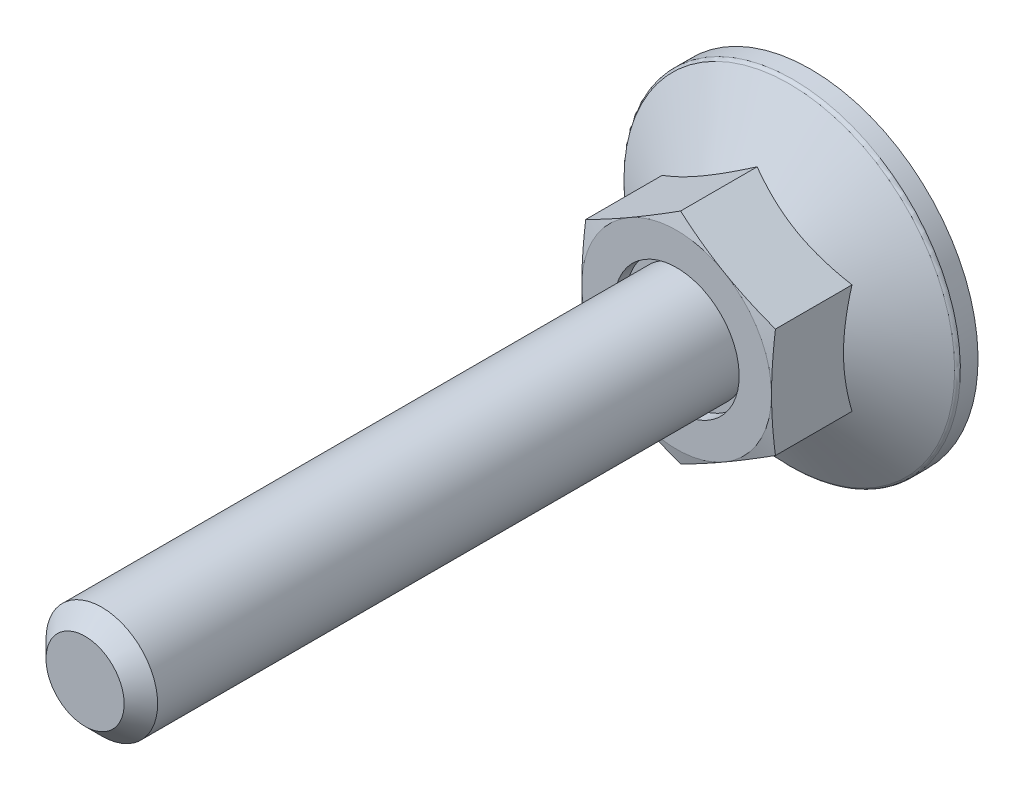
ISO-10303-21;
HEADER;
FILE_DESCRIPTION(('STEP AP214'),'2;1');
FILE_NAME('part.step','',(''),(''),'','','');
FILE_SCHEMA(('AUTOMOTIVE_DESIGN { 1 0 10303 214 1 1 1 1 }'));
ENDSEC;
DATA;
#1=APPLICATION_CONTEXT('core data for automotive mechanical design processes');
#2=APPLICATION_PROTOCOL_DEFINITION('international standard','automotive_design',2000,#1);
#3=PRODUCT_CONTEXT('',#1,'mechanical');
#4=PRODUCT('Part','Part','',(#3));
#5=PRODUCT_RELATED_PRODUCT_CATEGORY('part','',(#4));
#6=PRODUCT_DEFINITION_FORMATION('','',#4);
#7=PRODUCT_DEFINITION_CONTEXT('part definition',#1,'design');
#8=PRODUCT_DEFINITION('design','',#6,#7);
#9=PRODUCT_DEFINITION_SHAPE('','',#8);
#10=(LENGTH_UNIT() NAMED_UNIT(*) SI_UNIT(.MILLI.,.METRE.));
#11=(NAMED_UNIT(*) PLANE_ANGLE_UNIT() SI_UNIT($,.RADIAN.));
#12=(NAMED_UNIT(*) SI_UNIT($,.STERADIAN.) SOLID_ANGLE_UNIT());
#13=UNCERTAINTY_MEASURE_WITH_UNIT(LENGTH_MEASURE(1.E-05),#10,'distance_accuracy_value','');
#14=(GEOMETRIC_REPRESENTATION_CONTEXT(3) GLOBAL_UNCERTAINTY_ASSIGNED_CONTEXT((#13)) GLOBAL_UNIT_ASSIGNED_CONTEXT((#10,
#11,#12)) REPRESENTATION_CONTEXT('',''));
#15=CARTESIAN_POINT('',(0.,0.,0.));
#16=DIRECTION('',(0.,0.,1.));
#17=DIRECTION('',(1.,0.,0.));
#18=AXIS2_PLACEMENT_3D('',#15,#16,#17);
#19=CARTESIAN_POINT('',(0.,0.,10.9));
#20=DIRECTION('',(0.,0.,-1.));
#21=DIRECTION('',(0.,1.,0.));
#22=AXIS2_PLACEMENT_3D('',#19,#20,#21);
#23=PLANE('',#22);
#24=CARTESIAN_POINT('',(0.,0.,10.9));
#25=DIRECTION('',(0.,0.,-1.));
#26=DIRECTION('',(0.,1.,0.));
#27=AXIS2_PLACEMENT_3D('',#24,#25,#26);
#28=CIRCLE('',#27,5.6);
#29=CARTESIAN_POINT('',(0.,5.6,10.9));
#30=VERTEX_POINT('',#29);
#31=EDGE_CURVE('E346',#30,#30,#28,.F.);
#32=ORIENTED_EDGE('',*,*,#31,.T.);
#33=EDGE_LOOP('',(#32));
#34=FACE_BOUND('',#33,.T.);
#35=CARTESIAN_POINT('',(0.,0.,10.9));
#36=DIRECTION('',(0.,0.,-1.));
#37=DIRECTION('',(0.,1.,0.));
#38=AXIS2_PLACEMENT_3D('',#35,#36,#37);
#39=CIRCLE('',#38,5.);
#40=CARTESIAN_POINT('',(0.,5.,10.9));
#41=VERTEX_POINT('',#40);
#42=EDGE_CURVE('E349',#41,#41,#39,.F.);
#43=ORIENTED_EDGE('',*,*,#42,.F.);
#44=EDGE_LOOP('',(#43));
#45=FACE_BOUND('',#44,.T.);
#46=ADVANCED_FACE('F14',(#34,#45),#23,.F.);
#47=CARTESIAN_POINT('',(10.2,0.,0.));
#48=DIRECTION('',(0.,0.,1.));
#49=DIRECTION('',(0.,-1.,0.));
#50=AXIS2_PLACEMENT_3D('',#47,#48,#49);
#51=PLANE('',#50);
#52=DIRECTION('',(1.,0.,0.));
#53=VECTOR('',#52,1.);
#54=CARTESIAN_POINT('',(1.,-1.,0.));
#55=LINE('',#54,#53);
#56=CARTESIAN_POINT('',(1.,-1.,0.));
#57=VERTEX_POINT('',#56);
#58=CARTESIAN_POINT('',(5.,-1.,0.));
#59=VERTEX_POINT('',#58);
#60=EDGE_CURVE('E697',#57,#59,#55,.T.);
#61=ORIENTED_EDGE('',*,*,#60,.T.);
#62=DIRECTION('',(0.,-1.,0.));
#63=VECTOR('',#62,1.);
#64=CARTESIAN_POINT('',(5.,0.,0.));
#65=LINE('',#64,#63);
#66=CARTESIAN_POINT('',(5.,1.,0.));
#67=VERTEX_POINT('',#66);
#68=EDGE_CURVE('E351',#67,#59,#65,.T.);
#69=ORIENTED_EDGE('',*,*,#68,.F.);
#70=DIRECTION('',(-1.,0.,0.));
#71=VECTOR('',#70,1.);
#72=CARTESIAN_POINT('',(5.,1.,0.));
#73=LINE('',#72,#71);
#74=CARTESIAN_POINT('',(1.,1.,0.));
#75=VERTEX_POINT('',#74);
#76=EDGE_CURVE('E700',#67,#75,#73,.T.);
#77=ORIENTED_EDGE('',*,*,#76,.T.);
#78=DIRECTION('',(0.,1.,0.));
#79=VECTOR('',#78,1.);
#80=CARTESIAN_POINT('',(1.,1.,0.));
#81=LINE('',#80,#79);
#82=CARTESIAN_POINT('',(1.,5.,0.));
#83=VERTEX_POINT('',#82);
#84=EDGE_CURVE('E703',#75,#83,#81,.T.);
#85=ORIENTED_EDGE('',*,*,#84,.T.);
#86=DIRECTION('',(-1.,0.,0.));
#87=VECTOR('',#86,1.);
#88=CARTESIAN_POINT('',(1.,5.,0.));
#89=LINE('',#88,#87);
#90=CARTESIAN_POINT('',(-1.,5.,0.));
#91=VERTEX_POINT('',#90);
#92=EDGE_CURVE('E706',#83,#91,#89,.T.);
#93=ORIENTED_EDGE('',*,*,#92,.T.);
#94=DIRECTION('',(0.,-1.,0.));
#95=VECTOR('',#94,1.);
#96=CARTESIAN_POINT('',(-1.,5.,0.));
#97=LINE('',#96,#95);
#98=CARTESIAN_POINT('',(-1.,1.,0.));
#99=VERTEX_POINT('',#98);
#100=EDGE_CURVE('E175',#91,#99,#97,.T.);
#101=ORIENTED_EDGE('',*,*,#100,.T.);
#102=DIRECTION('',(-1.,0.,0.));
#103=VECTOR('',#102,1.);
#104=CARTESIAN_POINT('',(-1.,1.,0.));
#105=LINE('',#104,#103);
#106=CARTESIAN_POINT('',(-5.,1.,0.));
#107=VERTEX_POINT('',#106);
#108=EDGE_CURVE('E29',#99,#107,#105,.T.);
#109=ORIENTED_EDGE('',*,*,#108,.T.);
#110=DIRECTION('',(0.,-1.,0.));
#111=VECTOR('',#110,1.);
#112=CARTESIAN_POINT('',(-5.,1.,0.));
#113=LINE('',#112,#111);
#114=CARTESIAN_POINT('',(-5.,-1.,0.));
#115=VERTEX_POINT('',#114);
#116=EDGE_CURVE('E179',#107,#115,#113,.T.);
#117=ORIENTED_EDGE('',*,*,#116,.T.);
#118=DIRECTION('',(1.,0.,0.));
#119=VECTOR('',#118,1.);
#120=CARTESIAN_POINT('',(-5.,-1.,0.));
#121=LINE('',#120,#119);
#122=CARTESIAN_POINT('',(-1.,-1.,0.));
#123=VERTEX_POINT('',#122);
#124=EDGE_CURVE('E685',#115,#123,#121,.T.);
#125=ORIENTED_EDGE('',*,*,#124,.T.);
#126=DIRECTION('',(0.,-1.,0.));
#127=VECTOR('',#126,1.);
#128=CARTESIAN_POINT('',(-1.,-1.,0.));
#129=LINE('',#128,#127);
#130=CARTESIAN_POINT('',(-1.,-5.,0.));
#131=VERTEX_POINT('',#130);
#132=EDGE_CURVE('E688',#123,#131,#129,.T.);
#133=ORIENTED_EDGE('',*,*,#132,.T.);
#134=DIRECTION('',(1.,0.,0.));
#135=VECTOR('',#134,1.);
#136=CARTESIAN_POINT('',(-1.,-5.,0.));
#137=LINE('',#136,#135);
#138=CARTESIAN_POINT('',(1.,-5.,0.));
#139=VERTEX_POINT('',#138);
#140=EDGE_CURVE('E691',#131,#139,#137,.T.);
#141=ORIENTED_EDGE('',*,*,#140,.T.);
#142=DIRECTION('',(0.,1.,0.));
#143=VECTOR('',#142,1.);
#144=CARTESIAN_POINT('',(1.,-5.,0.));
#145=LINE('',#144,#143);
#146=EDGE_CURVE('E694',#139,#57,#145,.T.);
#147=ORIENTED_EDGE('',*,*,#146,.T.);
#148=EDGE_LOOP('',(#61,#69,#77,#85,#93,#101,#109,#117,#125,#133,#141,#147));
#149=FACE_BOUND('',#148,.T.);
#150=CARTESIAN_POINT('',(0.,0.,0.));
#151=DIRECTION('',(0.,0.,-1.));
#152=DIRECTION('',(0.,1.,0.));
#153=AXIS2_PLACEMENT_3D('',#150,#151,#152);
#154=CIRCLE('',#153,15.);
#155=CARTESIAN_POINT('',(0.,15.,0.));
#156=VERTEX_POINT('',#155);
#157=EDGE_CURVE('E180',#156,#156,#154,.T.);
#158=ORIENTED_EDGE('',*,*,#157,.T.);
#159=EDGE_LOOP('',(#158));
#160=FACE_BOUND('',#159,.T.);
#161=ADVANCED_FACE('F294',(#149,#160),#51,.F.);
#162=CARTESIAN_POINT('',(0.,9.81495457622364,44.));
#163=DIRECTION('',(0.5,-0.866025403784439,0.));
#164=DIRECTION('',(0.866025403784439,0.5,0.));
#165=AXIS2_PLACEMENT_3D('',#162,#163,#164);
#166=PLANE('',#165);
#167=CARTESIAN_POINT('',(-8.5002,4.90736181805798,4.7935207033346));
#168=CARTESIAN_POINT('',(-8.31336077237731,5.01523349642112,4.85579061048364));
#169=CARTESIAN_POINT('',(-8.1258249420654,5.1235073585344,4.91523445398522));
#170=CARTESIAN_POINT('',(-7.74923024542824,5.34093440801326,5.02769163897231));
#171=CARTESIAN_POINT('',(-7.56017075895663,5.45008795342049,5.08070220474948));
#172=CARTESIAN_POINT('',(-6.9899652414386,5.77929626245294,5.22904336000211));
#173=CARTESIAN_POINT('',(-6.60656835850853,6.00065055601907,5.31341782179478));
#174=CARTESIAN_POINT('',(-6.03282233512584,6.33190297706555,5.41235673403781));
#175=CARTESIAN_POINT('',(-5.84418723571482,6.44081150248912,5.44054155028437));
#176=CARTESIAN_POINT('',(-5.46606397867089,6.65912106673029,5.48780266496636));
#177=CARTESIAN_POINT('',(-5.27657589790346,6.76852206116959,5.5068797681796));
#178=CARTESIAN_POINT('',(-4.8972734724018,6.98751241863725,5.53544197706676));
#179=CARTESIAN_POINT('',(-4.70745974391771,7.09710142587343,5.54493796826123));
#180=CARTESIAN_POINT('',(-4.32765694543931,7.3163806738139,5.55413437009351));
#181=CARTESIAN_POINT('',(-4.13766788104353,7.42607091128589,5.5538350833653));
#182=CARTESIAN_POINT('',(-3.78247698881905,7.63114046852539,5.54412227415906));
#183=CARTESIAN_POINT('',(-3.6172500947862,7.72653426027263,5.535893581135));
#184=CARTESIAN_POINT('',(-3.28718328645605,7.9170984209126,5.51218750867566));
#185=CARTESIAN_POINT('',(-3.12234339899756,8.01226877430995,5.49670964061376));
#186=CARTESIAN_POINT('',(-2.62846189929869,8.29741139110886,5.43976812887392));
#187=CARTESIAN_POINT('',(-2.30029449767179,8.48687892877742,5.38780368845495));
#188=CARTESIAN_POINT('',(-1.64047857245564,8.86782383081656,5.25789180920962));
#189=CARTESIAN_POINT('',(-1.30891425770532,9.05925257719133,5.17939367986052));
#190=CARTESIAN_POINT('',(-0.650730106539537,9.43925537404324,5.00123540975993));
#191=CARTESIAN_POINT('',(-0.324101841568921,9.62783429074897,4.90161711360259));
#192=CARTESIAN_POINT('',(0.000199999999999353,9.81507004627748,4.7935207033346));
#193=B_SPLINE_CURVE_WITH_KNOTS('',3,(#167,#168,#169,#170,#171,#172,#173,#174,#175,#176,#177,
#178,#179,#180,#181,#182,#183,#184,#185,#186,#187,#188,#189,#190,#191,#192),.UNSPECIFIED.,.F.,
.F.,(4,2,2,2,2,2,2,2,2,2,2,2,4),(0.,0.673596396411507,1.34748239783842,2.69805431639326,
3.356799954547,4.01548737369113,4.67342558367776,5.33134346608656,5.90409556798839,
6.47688628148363,7.62328361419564,8.79510569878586,9.9646274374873),.UNSPECIFIED.);
#194=CARTESIAN_POINT('',(-8.5,4.90747728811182,4.79358737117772));
#195=VERTEX_POINT('',#194);
#196=CARTESIAN_POINT('',(0.,9.81495457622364,4.79358737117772));
#197=VERTEX_POINT('',#196);
#198=EDGE_CURVE('E251',#195,#197,#193,.T.);
#199=ORIENTED_EDGE('',*,*,#198,.F.);
#200=DIRECTION('',(0.,0.,-1.));
#201=VECTOR('',#200,1.);
#202=CARTESIAN_POINT('',(-8.5,4.90747728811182,44.));
#203=LINE('',#202,#201);
#204=CARTESIAN_POINT('',(-8.5,4.90747728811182,11.6476589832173));
#205=VERTEX_POINT('',#204);
#206=EDGE_CURVE('E408',#205,#195,#203,.T.);
#207=ORIENTED_EDGE('',*,*,#206,.F.);
#208=CARTESIAN_POINT('',(0.000200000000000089,9.81507004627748,11.6476280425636));
#209=CARTESIAN_POINT('',(-0.352800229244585,9.61126526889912,11.7022599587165));
#210=CARTESIAN_POINT('',(-0.706440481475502,9.40709097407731,11.7518566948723));
#211=CARTESIAN_POINT('',(-1.41496987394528,8.99802133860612,11.8389934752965));
#212=CARTESIAN_POINT('',(-1.76985946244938,8.79312573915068,11.8765286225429));
#213=CARTESIAN_POINT('',(-2.47873586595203,8.38385575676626,11.9373509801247));
#214=CARTESIAN_POINT('',(-2.83271788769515,8.17948414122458,11.9607107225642));
#215=CARTESIAN_POINT('',(-3.5411333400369,7.77048028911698,11.9920337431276));
#216=CARTESIAN_POINT('',(-3.89556667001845,7.56584811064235,12.));
#217=CARTESIAN_POINT('',(-4.60443332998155,7.15658375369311,12.));
#218=CARTESIAN_POINT('',(-4.9588666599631,6.95195157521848,11.9920337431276));
#219=CARTESIAN_POINT('',(-5.66728211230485,6.54294772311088,11.9607107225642));
#220=CARTESIAN_POINT('',(-6.02126413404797,6.33857610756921,11.9373509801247));
#221=CARTESIAN_POINT('',(-6.73014053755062,5.92930612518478,11.8765286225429));
#222=CARTESIAN_POINT('',(-7.08503012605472,5.72441052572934,11.8389934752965));
#223=CARTESIAN_POINT('',(-7.7935595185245,5.31534089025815,11.7518566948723));
#224=CARTESIAN_POINT('',(-8.14719977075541,5.11116659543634,11.7022599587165));
#225=CARTESIAN_POINT('',(-8.5002,4.90736181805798,11.6476280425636));
#226=B_SPLINE_CURVE_WITH_KNOTS('',3,(#208,#209,#210,#211,#212,#213,#214,#215,#216,#217,#218,
#219,#220,#221,#222,#223,#224,#225),.UNSPECIFIED.,.F.,.F.,(4,2,2,2,2,2,2,2,4),(0.,
1.23382789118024,2.46815608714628,3.69611406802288,4.92383440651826,6.15155474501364,
7.37951272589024,8.61384092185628,9.84766881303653),.UNSPECIFIED.);
#227=CARTESIAN_POINT('',(-4.25,7.36121593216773,12.));
#228=VERTEX_POINT('',#227);
#229=EDGE_CURVE('E281',#228,#205,#226,.T.);
#230=ORIENTED_EDGE('',*,*,#229,.F.);
#231=CARTESIAN_POINT('',(0.,9.81495457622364,11.6476589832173));
#232=VERTEX_POINT('',#231);
#233=EDGE_CURVE('E372',#232,#228,#226,.T.);
#234=ORIENTED_EDGE('',*,*,#233,.F.);
#235=DIRECTION('',(0.,0.,-1.));
#236=VECTOR('',#235,1.);
#237=CARTESIAN_POINT('',(0.,9.81495457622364,44.));
#238=LINE('',#237,#236);
#239=EDGE_CURVE('E392',#232,#197,#238,.T.);
#240=ORIENTED_EDGE('',*,*,#239,.T.);
#241=EDGE_LOOP('',(#199,#207,#230,#234,#240));
#242=FACE_BOUND('',#241,.T.);
#243=ADVANCED_FACE('F223',(#242),#166,.F.);
#244=CARTESIAN_POINT('',(8.5,4.90747728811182,44.));
#245=DIRECTION('',(-0.5,-0.866025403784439,0.));
#246=DIRECTION('',(0.866025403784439,-0.5,0.));
#247=AXIS2_PLACEMENT_3D('',#244,#245,#246);
#248=PLANE('',#247);
#249=CARTESIAN_POINT('',(-0.0002,9.81507004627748,4.7935207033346));
#250=CARTESIAN_POINT('',(0.186639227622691,9.70719836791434,4.85579061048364));
#251=CARTESIAN_POINT('',(0.374175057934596,9.59892450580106,4.91523445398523));
#252=CARTESIAN_POINT('',(0.750769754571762,9.3814974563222,5.02769163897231));
#253=CARTESIAN_POINT('',(0.939829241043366,9.27234391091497,5.08070220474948));
#254=CARTESIAN_POINT('',(1.5100347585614,8.94313560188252,5.22904336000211));
#255=CARTESIAN_POINT('',(1.89343164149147,8.72178130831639,5.31341782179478));
#256=CARTESIAN_POINT('',(2.46717766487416,8.39052888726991,5.41235673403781));
#257=CARTESIAN_POINT('',(2.65581276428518,8.28162036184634,5.44054155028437));
#258=CARTESIAN_POINT('',(3.03393602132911,8.06331079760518,5.48780266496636));
#259=CARTESIAN_POINT('',(3.22342410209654,7.95390980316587,5.5068797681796));
#260=CARTESIAN_POINT('',(3.6027265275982,7.73491944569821,5.53544197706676));
#261=CARTESIAN_POINT('',(3.79254025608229,7.62533043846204,5.54493796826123));
#262=CARTESIAN_POINT('',(4.17234305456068,7.40605119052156,5.55413437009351));
#263=CARTESIAN_POINT('',(4.36233211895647,7.29636095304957,5.55383508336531));
#264=CARTESIAN_POINT('',(4.71752301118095,7.09129139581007,5.54412227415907));
#265=CARTESIAN_POINT('',(4.8827499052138,6.99589760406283,5.53589358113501));
#266=CARTESIAN_POINT('',(5.21281671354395,6.80533344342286,5.51218750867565));
#267=CARTESIAN_POINT('',(5.37765660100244,6.71016309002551,5.49670964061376));
#268=CARTESIAN_POINT('',(5.87153810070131,6.42502047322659,5.43976812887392));
#269=CARTESIAN_POINT('',(6.19970550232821,6.23555293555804,5.38780368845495));
#270=CARTESIAN_POINT('',(6.85952142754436,5.8546080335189,5.25789180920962));
#271=CARTESIAN_POINT('',(7.19108574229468,5.66317928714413,5.17939367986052));
#272=CARTESIAN_POINT('',(7.84926989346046,5.28317649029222,5.00123540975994));
#273=CARTESIAN_POINT('',(8.17589815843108,5.09459757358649,4.90161711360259));
#274=CARTESIAN_POINT('',(8.5002,4.90736181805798,4.7935207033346));
#275=B_SPLINE_CURVE_WITH_KNOTS('',3,(#249,#250,#251,#252,#253,#254,#255,#256,#257,#258,#259,
#260,#261,#262,#263,#264,#265,#266,#267,#268,#269,#270,#271,#272,#273,#274),.UNSPECIFIED.,.F.,
.F.,(4,2,2,2,2,2,2,2,2,2,2,2,4),(0.,0.673596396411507,1.34748239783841,2.69805431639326,
3.356799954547,4.01548737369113,4.67342558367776,5.33134346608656,5.90409556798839,
6.47688628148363,7.62328361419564,8.79510569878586,9.9646274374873),.UNSPECIFIED.);
#276=CARTESIAN_POINT('',(8.5,4.90747728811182,4.79358737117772));
#277=VERTEX_POINT('',#276);
#278=EDGE_CURVE('E37',#197,#277,#275,.T.);
#279=ORIENTED_EDGE('',*,*,#278,.F.);
#280=ORIENTED_EDGE('',*,*,#239,.F.);
#281=CARTESIAN_POINT('',(8.5002,4.90736181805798,11.6476280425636));
#282=CARTESIAN_POINT('',(8.14719977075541,5.11116659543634,11.7022599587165));
#283=CARTESIAN_POINT('',(7.7935595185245,5.31534089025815,11.7518566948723));
#284=CARTESIAN_POINT('',(7.08503012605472,5.72441052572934,11.8389934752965));
#285=CARTESIAN_POINT('',(6.73014053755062,5.92930612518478,11.8765286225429));
#286=CARTESIAN_POINT('',(6.02126413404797,6.33857610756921,11.9373509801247));
#287=CARTESIAN_POINT('',(5.66728211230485,6.54294772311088,11.9607107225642));
#288=CARTESIAN_POINT('',(4.9588666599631,6.95195157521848,11.9920337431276));
#289=CARTESIAN_POINT('',(4.60443332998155,7.15658375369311,12.));
#290=CARTESIAN_POINT('',(3.89556667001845,7.56584811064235,12.));
#291=CARTESIAN_POINT('',(3.5411333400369,7.77048028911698,11.9920337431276));
#292=CARTESIAN_POINT('',(2.83271788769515,8.17948414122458,11.9607107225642));
#293=CARTESIAN_POINT('',(2.47873586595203,8.38385575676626,11.9373509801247));
#294=CARTESIAN_POINT('',(1.76985946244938,8.79312573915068,11.8765286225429));
#295=CARTESIAN_POINT('',(1.41496987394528,8.99802133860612,11.8389934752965));
#296=CARTESIAN_POINT('',(0.706440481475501,9.40709097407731,11.7518566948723));
#297=CARTESIAN_POINT('',(0.352800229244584,9.61126526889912,11.7022599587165));
#298=CARTESIAN_POINT('',(-0.000200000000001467,9.81507004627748,11.6476280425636));
#299=B_SPLINE_CURVE_WITH_KNOTS('',3,(#281,#282,#283,#284,#285,#286,#287,#288,#289,#290,#291,
#292,#293,#294,#295,#296,#297,#298),.UNSPECIFIED.,.F.,.F.,(4,2,2,2,2,2,2,2,4),(0.,
1.23382789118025,2.46815608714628,3.69611406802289,4.92383440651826,6.15155474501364,
7.37951272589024,8.61384092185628,9.84766881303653),.UNSPECIFIED.);
#300=CARTESIAN_POINT('',(4.25,7.36121593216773,12.));
#301=VERTEX_POINT('',#300);
#302=EDGE_CURVE('E264',#301,#232,#299,.T.);
#303=ORIENTED_EDGE('',*,*,#302,.F.);
#304=CARTESIAN_POINT('',(8.5,4.90747728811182,11.6476589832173));
#305=VERTEX_POINT('',#304);
#306=EDGE_CURVE('E273',#305,#301,#299,.T.);
#307=ORIENTED_EDGE('',*,*,#306,.F.);
#308=DIRECTION('',(0.,0.,-1.));
#309=VECTOR('',#308,1.);
#310=CARTESIAN_POINT('',(8.5,4.90747728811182,44.));
#311=LINE('',#310,#309);
#312=EDGE_CURVE('E395',#305,#277,#311,.T.);
#313=ORIENTED_EDGE('',*,*,#312,.T.);
#314=EDGE_LOOP('',(#279,#280,#303,#307,#313));
#315=FACE_BOUND('',#314,.T.);
#316=ADVANCED_FACE('F257',(#315),#248,.F.);
#317=CARTESIAN_POINT('',(8.5,-4.90747728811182,44.));
#318=DIRECTION('',(-1.,0.,0.));
#319=DIRECTION('',(0.,-1.,0.));
#320=AXIS2_PLACEMENT_3D('',#317,#318,#319);
#321=PLANE('',#320);
#322=CARTESIAN_POINT('',(8.5,13.0314294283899,1.47752704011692));
#323=CARTESIAN_POINT('',(8.5,12.6612665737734,1.65647774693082));
#324=CARTESIAN_POINT('',(8.5,12.290237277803,1.83366776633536));
#325=CARTESIAN_POINT('',(8.5,11.5459841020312,2.1835324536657));
#326=CARTESIAN_POINT('',(8.5,11.1727598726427,2.3562063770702));
#327=CARTESIAN_POINT('',(8.5,10.4216603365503,2.69694543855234));
#328=CARTESIAN_POINT('',(8.5,10.0437706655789,2.86497902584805));
#329=CARTESIAN_POINT('',(8.5,9.2849306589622,3.19396010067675));
#330=CARTESIAN_POINT('',(8.5,8.90398047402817,3.35490793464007));
#331=CARTESIAN_POINT('',(8.5,8.12702308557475,3.67249615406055));
#332=CARTESIAN_POINT('',(8.5,7.73090483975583,3.82886642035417));
#333=CARTESIAN_POINT('',(8.5,6.93398073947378,4.12940330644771));
#334=CARTESIAN_POINT('',(8.5,6.53317435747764,4.27356853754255));
#335=CARTESIAN_POINT('',(8.5,5.72703031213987,4.54580160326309));
#336=CARTESIAN_POINT('',(8.5,5.32170421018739,4.67390329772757));
#337=CARTESIAN_POINT('',(8.5,4.50525785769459,4.90980359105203));
#338=CARTESIAN_POINT('',(8.5,4.09413952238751,5.01760873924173));
#339=CARTESIAN_POINT('',(8.5,3.26789885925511,5.20711197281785));
#340=CARTESIAN_POINT('',(8.5,2.85280627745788,5.28893618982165));
#341=CARTESIAN_POINT('',(8.5,2.22651264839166,5.38853539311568));
#342=CARTESIAN_POINT('',(8.5,2.01712321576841,5.41788026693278));
#343=CARTESIAN_POINT('',(8.5,1.59735566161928,5.46827917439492));
#344=CARTESIAN_POINT('',(8.5,1.38697763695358,5.48933400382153));
#345=CARTESIAN_POINT('',(8.5,0.968196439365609,5.52247691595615));
#346=CARTESIAN_POINT('',(8.5,0.759802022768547,5.53467524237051));
#347=CARTESIAN_POINT('',(8.5,0.342684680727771,5.55026003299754));
#348=CARTESIAN_POINT('',(8.5,0.133961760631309,5.5536466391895));
#349=CARTESIAN_POINT('',(8.5,-0.283445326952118,5.55152742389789));
#350=CARTESIAN_POINT('',(8.5,-0.492129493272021,5.546021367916));
#351=CARTESIAN_POINT('',(8.5,-0.909085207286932,5.52624824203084));
#352=CARTESIAN_POINT('',(8.5,-1.11735673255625,5.51198070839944));
#353=CARTESIAN_POINT('',(8.5,-1.62231800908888,5.46706351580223));
#354=CARTESIAN_POINT('',(8.5,-1.91862399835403,5.43201243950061));
#355=CARTESIAN_POINT('',(8.5,-2.50892471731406,5.34612267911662));
#356=CARTESIAN_POINT('',(8.5,-2.80291910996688,5.29528173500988));
#357=CARTESIAN_POINT('',(8.5,-3.68114216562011,5.12178025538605));
#358=CARTESIAN_POINT('',(8.5,-4.26128126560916,4.97817413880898));
#359=CARTESIAN_POINT('',(8.5,-5.12903133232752,4.73045572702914));
#360=CARTESIAN_POINT('',(8.5,-5.42116721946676,4.64129591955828));
#361=CARTESIAN_POINT('',(8.5,-6.0025970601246,4.45406394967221));
#362=CARTESIAN_POINT('',(8.5,-6.29189099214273,4.35599171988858));
#363=CARTESIAN_POINT('',(8.5,-6.86774141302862,4.15248019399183));
#364=CARTESIAN_POINT('',(8.5,-7.15429879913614,4.0470434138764));
#365=CARTESIAN_POINT('',(8.5,-7.72505625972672,3.83000899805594));
#366=CARTESIAN_POINT('',(8.5,-8.00925638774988,3.71841150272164));
#367=CARTESIAN_POINT('',(8.5,-8.7865968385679,3.40502511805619));
#368=CARTESIAN_POINT('',(8.5,-9.2776226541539,3.197996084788));
#369=CARTESIAN_POINT('',(8.5,-10.2546964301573,2.77246752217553));
#370=CARTESIAN_POINT('',(8.5,-10.7407438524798,2.55396676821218));
#371=CARTESIAN_POINT('',(8.5,-11.7090438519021,2.108282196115));
#372=CARTESIAN_POINT('',(8.5,-12.1912949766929,1.88109523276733));
#373=CARTESIAN_POINT('',(8.5,-13.1526185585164,1.42016244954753));
#374=CARTESIAN_POINT('',(8.5,-13.6316911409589,1.18641689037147));
#375=CARTESIAN_POINT('',(8.5,-14.588034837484,0.713462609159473));
#376=CARTESIAN_POINT('',(8.5,-15.0653020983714,0.47424611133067));
#377=CARTESIAN_POINT('',(8.5,-16.0177905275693,-0.00822936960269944));
#378=CARTESIAN_POINT('',(8.5,-16.4930116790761,-0.251488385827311));
#379=CARTESIAN_POINT('',(8.5,-17.4416812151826,-0.741191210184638));
#380=CARTESIAN_POINT('',(8.5,-17.9151299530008,-0.987634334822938));
#381=CARTESIAN_POINT('',(8.5,-18.8606492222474,-1.48315179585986));
#382=CARTESIAN_POINT('',(8.5,-19.3327197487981,-1.73222614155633));
#383=CARTESIAN_POINT('',(8.5,-20.6461392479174,-2.42904815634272));
#384=CARTESIAN_POINT('',(8.5,-21.4862394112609,-2.87914918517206));
#385=CARTESIAN_POINT('',(8.5,-23.1638169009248,-3.78432075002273));
#386=CARTESIAN_POINT('',(8.5,-24.0012940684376,-4.23939157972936));
#387=CARTESIAN_POINT('',(8.5,-25.671623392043,-5.15180725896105));
#388=CARTESIAN_POINT('',(8.5,-26.5044818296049,-5.60914061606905));
#389=CARTESIAN_POINT('',(8.5,-27.7525740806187,-6.29723391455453));
#390=CARTESIAN_POINT('',(8.5,-28.1683903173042,-6.52693873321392));
#391=CARTESIAN_POINT('',(8.5,-28.9996764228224,-6.98697325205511));
#392=CARTESIAN_POINT('',(8.5,-29.4151462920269,-7.21730295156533));
#393=CARTESIAN_POINT('',(8.5,-29.8304643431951,-7.44790614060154));
#394=B_SPLINE_CURVE_WITH_KNOTS('',3,(#322,#323,#324,#325,#326,#327,#328,#329,#330,#331,#332,
#333,#334,#335,#336,#337,#338,#339,#340,#341,#342,#343,#344,#345,#346,#347,#348,#349,#350,#351,
#352,#353,#354,#355,#356,#357,#358,#359,#360,#361,#362,#363,#364,#365,#366,#367,#368,#369,#370,
#371,#372,#373,#374,#375,#376,#377,#378,#379,#380,#381,#382,#383,#384,#385,#386,#387,#388,#389,
#390,#391,#392,#393),.UNSPECIFIED.,.F.,.F.,(4,2,2,2,2,2,2,2,2,2,2,2,2,2,2,2,2,2,2,2,2,2,2,2,2,2,
2,2,2,2,2,2,2,2,2,4),(0.,1.23346428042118,2.46713064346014,3.70776702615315,4.94834268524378,
6.22578289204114,7.5033682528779,8.77821366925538,10.0526470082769,11.32079515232,
11.9549638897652,12.5890717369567,13.2151443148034,13.8412068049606,14.4672858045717,
15.0933979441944,15.9880059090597,16.8827419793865,18.6732029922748,19.5894472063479,
20.5056983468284,21.4216379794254,22.3375567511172,23.9359919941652,25.5345982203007,
27.1337888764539,28.7329160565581,30.3344778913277,31.9360528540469,33.5372895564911,
35.1385319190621,37.9977422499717,40.8571224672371,43.7075995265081,45.1327331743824,
46.5578652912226),.UNSPECIFIED.);
#395=CARTESIAN_POINT('',(8.5,-4.90747728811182,4.79358737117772));
#396=VERTEX_POINT('',#395);
#397=EDGE_CURVE('E240',#277,#396,#394,.T.);
#398=ORIENTED_EDGE('',*,*,#397,.F.);
#399=ORIENTED_EDGE('',*,*,#312,.F.);
#400=CARTESIAN_POINT('',(8.5,12.9820891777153,10.1197370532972));
#401=CARTESIAN_POINT('',(8.5,12.5964686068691,10.2061594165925));
#402=CARTESIAN_POINT('',(8.5,12.2106068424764,10.2915248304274));
#403=CARTESIAN_POINT('',(8.5,11.4382824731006,10.4595712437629));
#404=CARTESIAN_POINT('',(8.5,11.0518198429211,10.5422521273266));
#405=CARTESIAN_POINT('',(8.5,10.2778290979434,10.7044309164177));
#406=CARTESIAN_POINT('',(8.5,9.89030030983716,10.7839256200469));
#407=CARTESIAN_POINT('',(8.5,9.11443612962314,10.9388739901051));
#408=CARTESIAN_POINT('',(8.5,8.72610074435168,11.0143276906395));
#409=CARTESIAN_POINT('',(8.5,7.95158013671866,11.159650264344));
#410=CARTESIAN_POINT('',(8.5,7.56540239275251,11.2295587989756));
#411=CARTESIAN_POINT('',(8.5,6.79199352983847,11.3632725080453));
#412=CARTESIAN_POINT('',(8.5,6.40476243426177,11.4270778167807));
#413=CARTESIAN_POINT('',(8.5,5.62917169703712,11.54714843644));
#414=CARTESIAN_POINT('',(8.5,5.24081220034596,11.6034146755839));
#415=CARTESIAN_POINT('',(8.5,4.46285737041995,11.70674908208));
#416=CARTESIAN_POINT('',(8.5,4.07326203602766,11.7538172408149));
#417=CARTESIAN_POINT('',(8.5,3.28844017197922,11.8374226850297));
#418=CARTESIAN_POINT('',(8.5,2.89320002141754,11.8738340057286));
#419=CARTESIAN_POINT('',(8.5,2.10172608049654,11.9336139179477));
#420=CARTESIAN_POINT('',(8.5,1.70549231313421,11.9569828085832));
#421=CARTESIAN_POINT('',(8.5,0.91260591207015,11.9893148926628));
#422=CARTESIAN_POINT('',(8.5,0.515953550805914,11.9982846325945));
#423=CARTESIAN_POINT('',(8.5,-0.277408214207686,12.0012669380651));
#424=CARTESIAN_POINT('',(8.5,-0.674117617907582,11.9952795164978));
#425=CARTESIAN_POINT('',(8.5,-1.46847963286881,11.9686842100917));
#426=CARTESIAN_POINT('',(8.5,-1.86613043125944,11.9480232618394));
#427=CARTESIAN_POINT('',(8.5,-2.66049684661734,11.8932602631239));
#428=CARTESIAN_POINT('',(8.5,-3.05721244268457,11.8591579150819));
#429=CARTESIAN_POINT('',(8.5,-3.84970511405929,11.7792347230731));
#430=CARTESIAN_POINT('',(8.5,-4.24548140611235,11.7334062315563));
#431=CARTESIAN_POINT('',(8.5,-5.03576028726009,11.6319377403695));
#432=CARTESIAN_POINT('',(8.5,-5.43026287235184,11.5762977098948));
#433=CARTESIAN_POINT('',(8.5,-6.19195385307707,11.4609360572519));
#434=CARTESIAN_POINT('',(8.5,-6.55922094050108,11.4017287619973));
#435=CARTESIAN_POINT('',(8.5,-7.29278719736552,11.2775674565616));
#436=CARTESIAN_POINT('',(8.5,-7.65908634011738,11.2126132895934));
#437=CARTESIAN_POINT('',(8.5,-8.39085027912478,11.078008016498));
#438=CARTESIAN_POINT('',(8.5,-8.75631499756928,11.0083564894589));
#439=CARTESIAN_POINT('',(8.5,-9.48649515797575,10.8652200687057));
#440=CARTESIAN_POINT('',(8.5,-9.85121059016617,10.7917351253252));
#441=CARTESIAN_POINT('',(8.5,-10.5800753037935,10.6416087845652));
#442=CARTESIAN_POINT('',(8.5,-10.944224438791,10.5649666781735));
#443=CARTESIAN_POINT('',(8.5,-11.6719684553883,10.4090909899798));
#444=CARTESIAN_POINT('',(8.5,-12.0355633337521,10.3298573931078));
#445=CARTESIAN_POINT('',(8.5,-13.1255915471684,10.0889686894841));
#446=CARTESIAN_POINT('',(8.5,-13.8513178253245,9.92411536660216));
#447=CARTESIAN_POINT('',(8.5,-15.2942598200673,9.59010912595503));
#448=CARTESIAN_POINT('',(8.5,-16.0114890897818,9.42101437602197));
#449=CARTESIAN_POINT('',(8.5,-17.4449475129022,9.07858755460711));
#450=CARTESIAN_POINT('',(8.5,-18.1611766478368,8.90525540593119));
#451=CARTESIAN_POINT('',(8.5,-19.5919856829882,8.5556799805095));
#452=CARTESIAN_POINT('',(8.5,-20.306566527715,8.37944056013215));
#453=CARTESIAN_POINT('',(8.5,-21.7351057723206,8.02455520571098));
#454=CARTESIAN_POINT('',(8.5,-22.4490641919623,7.8459093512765));
#455=CARTESIAN_POINT('',(8.5,-23.1628057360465,7.66641079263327));
#456=B_SPLINE_CURVE_WITH_KNOTS('',3,(#400,#401,#402,#403,#404,#405,#406,#407,#408,#409,#410,
#411,#412,#413,#414,#415,#416,#417,#418,#419,#420,#421,#422,#423,#424,#425,#426,#427,#428,#429,
#430,#431,#432,#433,#434,#435,#436,#437,#438,#439,#440,#441,#442,#443,#444,#445,#446,#447,#448,
#449,#450,#451,#452,#453,#454,#455),.UNSPECIFIED.,.F.,.F.,(4,2,2,2,2,2,2,2,2,2,2,2,2,2,2,2,2,2,
2,2,2,2,2,2,2,2,2,4),(0.,1.18556310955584,2.37117735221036,3.55795462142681,4.74472187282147,
5.92204594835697,7.09934411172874,8.27649719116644,9.45365137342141,10.6442044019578,
11.8347301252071,13.0247144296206,14.2146977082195,15.4090063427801,16.6033414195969,
17.7984574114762,18.9935771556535,20.1095500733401,21.2255534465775,22.3416569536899,
23.4577749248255,24.5741449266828,25.6905214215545,27.9231231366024,30.1337863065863,
32.3444897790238,34.5524651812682,36.7603677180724),.UNSPECIFIED.);
#457=CARTESIAN_POINT('',(8.5,0.,12.));
#458=VERTEX_POINT('',#457);
#459=EDGE_CURVE('E275',#458,#305,#456,.F.);
#460=ORIENTED_EDGE('',*,*,#459,.F.);
#461=CARTESIAN_POINT('',(8.5,-4.90747728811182,11.6476589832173));
#462=VERTEX_POINT('',#461);
#463=EDGE_CURVE('E274',#462,#458,#456,.F.);
#464=ORIENTED_EDGE('',*,*,#463,.F.);
#465=DIRECTION('',(0.,0.,-1.));
#466=VECTOR('',#465,1.);
#467=CARTESIAN_POINT('',(8.5,-4.90747728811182,44.));
#468=LINE('',#467,#466);
#469=EDGE_CURVE('E398',#462,#396,#468,.T.);
#470=ORIENTED_EDGE('',*,*,#469,.T.);
#471=EDGE_LOOP('',(#398,#399,#460,#464,#470));
#472=FACE_BOUND('',#471,.T.);
#473=ADVANCED_FACE('F260',(#472),#321,.F.);
#474=CARTESIAN_POINT('',(0.,-9.81495457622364,44.));
#475=DIRECTION('',(-0.5,0.866025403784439,0.));
#476=DIRECTION('',(-0.866025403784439,-0.5,0.));
#477=AXIS2_PLACEMENT_3D('',#474,#475,#476);
#478=PLANE('',#477);
#479=CARTESIAN_POINT('',(8.5002,-4.90736181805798,4.7935207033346));
#480=CARTESIAN_POINT('',(8.31336077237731,-5.01523349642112,4.85579061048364));
#481=CARTESIAN_POINT('',(8.1258249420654,-5.1235073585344,4.91523445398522));
#482=CARTESIAN_POINT('',(7.74923024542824,-5.34093440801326,5.02769163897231));
#483=CARTESIAN_POINT('',(7.56017075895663,-5.45008795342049,5.08070220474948));
#484=CARTESIAN_POINT('',(6.9899652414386,-5.77929626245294,5.22904336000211));
#485=CARTESIAN_POINT('',(6.60656835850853,-6.00065055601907,5.31341782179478));
#486=CARTESIAN_POINT('',(6.03282233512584,-6.33190297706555,5.41235673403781));
#487=CARTESIAN_POINT('',(5.84418723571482,-6.44081150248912,5.44054155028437));
#488=CARTESIAN_POINT('',(5.46606397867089,-6.65912106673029,5.48780266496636));
#489=CARTESIAN_POINT('',(5.27657589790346,-6.76852206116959,5.5068797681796));
#490=CARTESIAN_POINT('',(4.8972734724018,-6.98751241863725,5.53544197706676));
#491=CARTESIAN_POINT('',(4.70745974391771,-7.09710142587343,5.54493796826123));
#492=CARTESIAN_POINT('',(4.32765694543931,-7.3163806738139,5.55413437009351));
#493=CARTESIAN_POINT('',(4.13766788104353,-7.42607091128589,5.5538350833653));
#494=CARTESIAN_POINT('',(3.78247698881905,-7.63114046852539,5.54412227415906));
#495=CARTESIAN_POINT('',(3.6172500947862,-7.72653426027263,5.535893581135));
#496=CARTESIAN_POINT('',(3.28718328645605,-7.9170984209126,5.51218750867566));
#497=CARTESIAN_POINT('',(3.12234339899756,-8.01226877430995,5.49670964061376));
#498=CARTESIAN_POINT('',(2.62846189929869,-8.29741139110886,5.43976812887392));
#499=CARTESIAN_POINT('',(2.30029449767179,-8.48687892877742,5.38780368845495));
#500=CARTESIAN_POINT('',(1.64047857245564,-8.86782383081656,5.25789180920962));
#501=CARTESIAN_POINT('',(1.30891425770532,-9.05925257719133,5.17939367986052));
#502=CARTESIAN_POINT('',(0.650730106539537,-9.43925537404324,5.00123540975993));
#503=CARTESIAN_POINT('',(0.324101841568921,-9.62783429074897,4.90161711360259));
#504=CARTESIAN_POINT('',(-0.000199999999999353,-9.81507004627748,4.7935207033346));
#505=B_SPLINE_CURVE_WITH_KNOTS('',3,(#479,#480,#481,#482,#483,#484,#485,#486,#487,#488,#489,
#490,#491,#492,#493,#494,#495,#496,#497,#498,#499,#500,#501,#502,#503,#504),.UNSPECIFIED.,.F.,
.F.,(4,2,2,2,2,2,2,2,2,2,2,2,4),(0.,0.673596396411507,1.34748239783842,2.69805431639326,
3.356799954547,4.01548737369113,4.67342558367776,5.33134346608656,5.90409556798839,
6.47688628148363,7.62328361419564,8.79510569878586,9.9646274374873),.UNSPECIFIED.);
#506=CARTESIAN_POINT('',(0.,-9.81495457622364,4.79358737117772));
#507=VERTEX_POINT('',#506);
#508=EDGE_CURVE('E204',#396,#507,#505,.T.);
#509=ORIENTED_EDGE('',*,*,#508,.F.);
#510=ORIENTED_EDGE('',*,*,#469,.F.);
#511=CARTESIAN_POINT('',(-0.000200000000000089,-9.81507004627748,11.6476280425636));
#512=CARTESIAN_POINT('',(0.352800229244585,-9.61126526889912,11.7022599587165));
#513=CARTESIAN_POINT('',(0.706440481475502,-9.40709097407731,11.7518566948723));
#514=CARTESIAN_POINT('',(1.41496987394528,-8.99802133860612,11.8389934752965));
#515=CARTESIAN_POINT('',(1.76985946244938,-8.79312573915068,11.8765286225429));
#516=CARTESIAN_POINT('',(2.47873586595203,-8.38385575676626,11.9373509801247));
#517=CARTESIAN_POINT('',(2.83271788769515,-8.17948414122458,11.9607107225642));
#518=CARTESIAN_POINT('',(3.5411333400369,-7.77048028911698,11.9920337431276));
#519=CARTESIAN_POINT('',(3.89556667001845,-7.56584811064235,12.));
#520=CARTESIAN_POINT('',(4.60443332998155,-7.15658375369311,12.));
#521=CARTESIAN_POINT('',(4.9588666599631,-6.95195157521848,11.9920337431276));
#522=CARTESIAN_POINT('',(5.66728211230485,-6.54294772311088,11.9607107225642));
#523=CARTESIAN_POINT('',(6.02126413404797,-6.33857610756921,11.9373509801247));
#524=CARTESIAN_POINT('',(6.73014053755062,-5.92930612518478,11.8765286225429));
#525=CARTESIAN_POINT('',(7.08503012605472,-5.72441052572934,11.8389934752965));
#526=CARTESIAN_POINT('',(7.7935595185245,-5.31534089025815,11.7518566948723));
#527=CARTESIAN_POINT('',(8.14719977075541,-5.11116659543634,11.7022599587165));
#528=CARTESIAN_POINT('',(8.5002,-4.90736181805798,11.6476280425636));
#529=B_SPLINE_CURVE_WITH_KNOTS('',3,(#511,#512,#513,#514,#515,#516,#517,#518,#519,#520,#521,
#522,#523,#524,#525,#526,#527,#528),.UNSPECIFIED.,.F.,.F.,(4,2,2,2,2,2,2,2,4),(0.,
1.23382789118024,2.46815608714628,3.69611406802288,4.92383440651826,6.15155474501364,
7.37951272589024,8.61384092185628,9.84766881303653),.UNSPECIFIED.);
#530=CARTESIAN_POINT('',(4.25,-7.36121593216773,12.));
#531=VERTEX_POINT('',#530);
#532=EDGE_CURVE('E313',#531,#462,#529,.T.);
#533=ORIENTED_EDGE('',*,*,#532,.F.);
#534=CARTESIAN_POINT('',(0.,-9.81495457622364,11.6476589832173));
#535=VERTEX_POINT('',#534);
#536=EDGE_CURVE('E319',#535,#531,#529,.T.);
#537=ORIENTED_EDGE('',*,*,#536,.F.);
#538=DIRECTION('',(0.,0.,-1.));
#539=VECTOR('',#538,1.);
#540=CARTESIAN_POINT('',(0.,-9.81495457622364,44.));
#541=LINE('',#540,#539);
#542=EDGE_CURVE('E403',#535,#507,#541,.T.);
#543=ORIENTED_EDGE('',*,*,#542,.T.);
#544=EDGE_LOOP('',(#509,#510,#533,#537,#543));
#545=FACE_BOUND('',#544,.T.);
#546=ADVANCED_FACE('F321',(#545),#478,.F.);
#547=CARTESIAN_POINT('',(-8.5,-4.90747728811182,44.));
#548=DIRECTION('',(0.5,0.866025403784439,0.));
#549=DIRECTION('',(-0.866025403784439,0.5,0.));
#550=AXIS2_PLACEMENT_3D('',#547,#548,#549);
#551=PLANE('',#550);
#552=CARTESIAN_POINT('',(0.0002,-9.81507004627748,4.7935207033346));
#553=CARTESIAN_POINT('',(-0.186639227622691,-9.70719836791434,4.85579061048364));
#554=CARTESIAN_POINT('',(-0.374175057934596,-9.59892450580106,4.91523445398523));
#555=CARTESIAN_POINT('',(-0.750769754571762,-9.3814974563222,5.02769163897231));
#556=CARTESIAN_POINT('',(-0.939829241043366,-9.27234391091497,5.08070220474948));
#557=CARTESIAN_POINT('',(-1.5100347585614,-8.94313560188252,5.22904336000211));
#558=CARTESIAN_POINT('',(-1.89343164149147,-8.72178130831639,5.31341782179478));
#559=CARTESIAN_POINT('',(-2.46717766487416,-8.39052888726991,5.41235673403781));
#560=CARTESIAN_POINT('',(-2.65581276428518,-8.28162036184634,5.44054155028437));
#561=CARTESIAN_POINT('',(-3.03393602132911,-8.06331079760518,5.48780266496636));
#562=CARTESIAN_POINT('',(-3.22342410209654,-7.95390980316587,5.5068797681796));
#563=CARTESIAN_POINT('',(-3.6027265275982,-7.73491944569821,5.53544197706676));
#564=CARTESIAN_POINT('',(-3.79254025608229,-7.62533043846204,5.54493796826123));
#565=CARTESIAN_POINT('',(-4.17234305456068,-7.40605119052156,5.55413437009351));
#566=CARTESIAN_POINT('',(-4.36233211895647,-7.29636095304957,5.55383508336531));
#567=CARTESIAN_POINT('',(-4.71752301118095,-7.09129139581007,5.54412227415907));
#568=CARTESIAN_POINT('',(-4.8827499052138,-6.99589760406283,5.53589358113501));
#569=CARTESIAN_POINT('',(-5.21281671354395,-6.80533344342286,5.51218750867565));
#570=CARTESIAN_POINT('',(-5.37765660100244,-6.71016309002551,5.49670964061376));
#571=CARTESIAN_POINT('',(-5.87153810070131,-6.42502047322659,5.43976812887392));
#572=CARTESIAN_POINT('',(-6.19970550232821,-6.23555293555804,5.38780368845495));
#573=CARTESIAN_POINT('',(-6.85952142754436,-5.8546080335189,5.25789180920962));
#574=CARTESIAN_POINT('',(-7.19108574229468,-5.66317928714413,5.17939367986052));
#575=CARTESIAN_POINT('',(-7.84926989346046,-5.28317649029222,5.00123540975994));
#576=CARTESIAN_POINT('',(-8.17589815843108,-5.09459757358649,4.90161711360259));
#577=CARTESIAN_POINT('',(-8.5002,-4.90736181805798,4.7935207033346));
#578=B_SPLINE_CURVE_WITH_KNOTS('',3,(#552,#553,#554,#555,#556,#557,#558,#559,#560,#561,#562,
#563,#564,#565,#566,#567,#568,#569,#570,#571,#572,#573,#574,#575,#576,#577),.UNSPECIFIED.,.F.,
.F.,(4,2,2,2,2,2,2,2,2,2,2,2,4),(0.,0.673596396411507,1.34748239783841,2.69805431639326,
3.356799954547,4.01548737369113,4.67342558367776,5.33134346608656,5.90409556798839,
6.47688628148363,7.62328361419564,8.79510569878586,9.9646274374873),.UNSPECIFIED.);
#579=CARTESIAN_POINT('',(-8.5,-4.90747728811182,4.79358737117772));
#580=VERTEX_POINT('',#579);
#581=EDGE_CURVE('E195',#507,#580,#578,.T.);
#582=ORIENTED_EDGE('',*,*,#581,.F.);
#583=ORIENTED_EDGE('',*,*,#542,.F.);
#584=CARTESIAN_POINT('',(-8.5002,-4.90736181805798,11.6476280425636));
#585=CARTESIAN_POINT('',(-8.14719977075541,-5.11116659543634,11.7022599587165));
#586=CARTESIAN_POINT('',(-7.7935595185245,-5.31534089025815,11.7518566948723));
#587=CARTESIAN_POINT('',(-7.08503012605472,-5.72441052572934,11.8389934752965));
#588=CARTESIAN_POINT('',(-6.73014053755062,-5.92930612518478,11.8765286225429));
#589=CARTESIAN_POINT('',(-6.02126413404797,-6.33857610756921,11.9373509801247));
#590=CARTESIAN_POINT('',(-5.66728211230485,-6.54294772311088,11.9607107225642));
#591=CARTESIAN_POINT('',(-4.9588666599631,-6.95195157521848,11.9920337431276));
#592=CARTESIAN_POINT('',(-4.60443332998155,-7.15658375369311,12.));
#593=CARTESIAN_POINT('',(-3.89556667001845,-7.56584811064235,12.));
#594=CARTESIAN_POINT('',(-3.5411333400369,-7.77048028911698,11.9920337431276));
#595=CARTESIAN_POINT('',(-2.83271788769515,-8.17948414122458,11.9607107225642));
#596=CARTESIAN_POINT('',(-2.47873586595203,-8.38385575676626,11.9373509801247));
#597=CARTESIAN_POINT('',(-1.76985946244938,-8.79312573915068,11.8765286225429));
#598=CARTESIAN_POINT('',(-1.41496987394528,-8.99802133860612,11.8389934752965));
#599=CARTESIAN_POINT('',(-0.706440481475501,-9.40709097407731,11.7518566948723));
#600=CARTESIAN_POINT('',(-0.352800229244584,-9.61126526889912,11.7022599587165));
#601=CARTESIAN_POINT('',(0.000200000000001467,-9.81507004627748,11.6476280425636));
#602=B_SPLINE_CURVE_WITH_KNOTS('',3,(#584,#585,#586,#587,#588,#589,#590,#591,#592,#593,#594,
#595,#596,#597,#598,#599,#600,#601),.UNSPECIFIED.,.F.,.F.,(4,2,2,2,2,2,2,2,4),(0.,
1.23382789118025,2.46815608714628,3.69611406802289,4.92383440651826,6.15155474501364,
7.37951272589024,8.61384092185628,9.84766881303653),.UNSPECIFIED.);
#603=CARTESIAN_POINT('',(-4.25,-7.36121593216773,12.));
#604=VERTEX_POINT('',#603);
#605=EDGE_CURVE('E307',#604,#535,#602,.T.);
#606=ORIENTED_EDGE('',*,*,#605,.F.);
#607=CARTESIAN_POINT('',(-8.5,-4.90747728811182,11.6476589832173));
#608=VERTEX_POINT('',#607);
#609=EDGE_CURVE('E320',#608,#604,#602,.T.);
#610=ORIENTED_EDGE('',*,*,#609,.F.);
#611=DIRECTION('',(0.,0.,-1.));
#612=VECTOR('',#611,1.);
#613=CARTESIAN_POINT('',(-8.5,-4.90747728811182,44.));
#614=LINE('',#613,#612);
#615=EDGE_CURVE('E406',#608,#580,#614,.T.);
#616=ORIENTED_EDGE('',*,*,#615,.T.);
#617=EDGE_LOOP('',(#582,#583,#606,#610,#616));
#618=FACE_BOUND('',#617,.T.);
#619=ADVANCED_FACE('F211',(#618),#551,.F.);
#620=CARTESIAN_POINT('',(-8.5,4.90747728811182,44.));
#621=DIRECTION('',(1.,0.,0.));
#622=DIRECTION('',(0.,1.,0.));
#623=AXIS2_PLACEMENT_3D('',#620,#621,#622);
#624=PLANE('',#623);
#625=CARTESIAN_POINT('',(-8.5,13.0314294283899,1.47752704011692));
#626=CARTESIAN_POINT('',(-8.5,12.6612665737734,1.65647774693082));
#627=CARTESIAN_POINT('',(-8.5,12.290237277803,1.83366776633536));
#628=CARTESIAN_POINT('',(-8.5,11.5459841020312,2.1835324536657));
#629=CARTESIAN_POINT('',(-8.5,11.1727598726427,2.3562063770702));
#630=CARTESIAN_POINT('',(-8.5,10.4216603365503,2.69694543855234));
#631=CARTESIAN_POINT('',(-8.5,10.0437706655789,2.86497902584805));
#632=CARTESIAN_POINT('',(-8.5,9.2849306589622,3.19396010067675));
#633=CARTESIAN_POINT('',(-8.5,8.90398047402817,3.35490793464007));
#634=CARTESIAN_POINT('',(-8.5,8.12702308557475,3.67249615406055));
#635=CARTESIAN_POINT('',(-8.5,7.73090483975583,3.82886642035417));
#636=CARTESIAN_POINT('',(-8.5,6.93398073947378,4.12940330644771));
#637=CARTESIAN_POINT('',(-8.5,6.53317435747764,4.27356853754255));
#638=CARTESIAN_POINT('',(-8.5,5.72703031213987,4.54580160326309));
#639=CARTESIAN_POINT('',(-8.5,5.32170421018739,4.67390329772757));
#640=CARTESIAN_POINT('',(-8.5,4.50525785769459,4.90980359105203));
#641=CARTESIAN_POINT('',(-8.5,4.09413952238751,5.01760873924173));
#642=CARTESIAN_POINT('',(-8.5,3.26789885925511,5.20711197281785));
#643=CARTESIAN_POINT('',(-8.5,2.85280627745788,5.28893618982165));
#644=CARTESIAN_POINT('',(-8.5,2.22651264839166,5.38853539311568));
#645=CARTESIAN_POINT('',(-8.5,2.01712321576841,5.41788026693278));
#646=CARTESIAN_POINT('',(-8.5,1.59735566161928,5.46827917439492));
#647=CARTESIAN_POINT('',(-8.5,1.38697763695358,5.48933400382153));
#648=CARTESIAN_POINT('',(-8.5,0.968196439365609,5.52247691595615));
#649=CARTESIAN_POINT('',(-8.5,0.759802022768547,5.53467524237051));
#650=CARTESIAN_POINT('',(-8.5,0.342684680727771,5.55026003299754));
#651=CARTESIAN_POINT('',(-8.5,0.133961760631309,5.5536466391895));
#652=CARTESIAN_POINT('',(-8.5,-0.283445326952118,5.55152742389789));
#653=CARTESIAN_POINT('',(-8.5,-0.492129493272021,5.546021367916));
#654=CARTESIAN_POINT('',(-8.5,-0.909085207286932,5.52624824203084));
#655=CARTESIAN_POINT('',(-8.5,-1.11735673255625,5.51198070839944));
#656=CARTESIAN_POINT('',(-8.5,-1.62231800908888,5.46706351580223));
#657=CARTESIAN_POINT('',(-8.5,-1.91862399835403,5.43201243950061));
#658=CARTESIAN_POINT('',(-8.5,-2.50892471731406,5.34612267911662));
#659=CARTESIAN_POINT('',(-8.5,-2.80291910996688,5.29528173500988));
#660=CARTESIAN_POINT('',(-8.5,-3.68114216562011,5.12178025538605));
#661=CARTESIAN_POINT('',(-8.5,-4.26128126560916,4.97817413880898));
#662=CARTESIAN_POINT('',(-8.5,-5.12903133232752,4.73045572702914));
#663=CARTESIAN_POINT('',(-8.5,-5.42116721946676,4.64129591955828));
#664=CARTESIAN_POINT('',(-8.5,-6.0025970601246,4.45406394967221));
#665=CARTESIAN_POINT('',(-8.5,-6.29189099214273,4.35599171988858));
#666=CARTESIAN_POINT('',(-8.5,-6.86774141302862,4.15248019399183));
#667=CARTESIAN_POINT('',(-8.5,-7.15429879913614,4.0470434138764));
#668=CARTESIAN_POINT('',(-8.5,-7.72505625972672,3.83000899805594));
#669=CARTESIAN_POINT('',(-8.5,-8.00925638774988,3.71841150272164));
#670=CARTESIAN_POINT('',(-8.5,-8.7865968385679,3.40502511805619));
#671=CARTESIAN_POINT('',(-8.5,-9.2776226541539,3.197996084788));
#672=CARTESIAN_POINT('',(-8.5,-10.2546964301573,2.77246752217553));
#673=CARTESIAN_POINT('',(-8.5,-10.7407438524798,2.55396676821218));
#674=CARTESIAN_POINT('',(-8.5,-11.7090438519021,2.108282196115));
#675=CARTESIAN_POINT('',(-8.5,-12.1912949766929,1.88109523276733));
#676=CARTESIAN_POINT('',(-8.5,-13.1526185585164,1.42016244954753));
#677=CARTESIAN_POINT('',(-8.5,-13.6316911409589,1.18641689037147));
#678=CARTESIAN_POINT('',(-8.5,-14.588034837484,0.713462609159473));
#679=CARTESIAN_POINT('',(-8.5,-15.0653020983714,0.47424611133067));
#680=CARTESIAN_POINT('',(-8.5,-16.0177905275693,-0.00822936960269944));
#681=CARTESIAN_POINT('',(-8.5,-16.4930116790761,-0.251488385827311));
#682=CARTESIAN_POINT('',(-8.5,-17.4416812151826,-0.741191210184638));
#683=CARTESIAN_POINT('',(-8.5,-17.9151299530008,-0.987634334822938));
#684=CARTESIAN_POINT('',(-8.5,-18.8606492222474,-1.48315179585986));
#685=CARTESIAN_POINT('',(-8.5,-19.3327197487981,-1.73222614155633));
#686=CARTESIAN_POINT('',(-8.5,-20.6461392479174,-2.42904815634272));
#687=CARTESIAN_POINT('',(-8.5,-21.4862394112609,-2.87914918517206));
#688=CARTESIAN_POINT('',(-8.5,-23.1638169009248,-3.78432075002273));
#689=CARTESIAN_POINT('',(-8.5,-24.0012940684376,-4.23939157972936));
#690=CARTESIAN_POINT('',(-8.5,-25.671623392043,-5.15180725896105));
#691=CARTESIAN_POINT('',(-8.5,-26.5044818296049,-5.60914061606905));
#692=CARTESIAN_POINT('',(-8.5,-27.7525740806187,-6.29723391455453));
#693=CARTESIAN_POINT('',(-8.5,-28.1683903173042,-6.52693873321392));
#694=CARTESIAN_POINT('',(-8.5,-28.9996764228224,-6.98697325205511));
#695=CARTESIAN_POINT('',(-8.5,-29.4151462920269,-7.21730295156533));
#696=CARTESIAN_POINT('',(-8.5,-29.8304643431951,-7.44790614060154));
#697=B_SPLINE_CURVE_WITH_KNOTS('',3,(#625,#626,#627,#628,#629,#630,#631,#632,#633,#634,#635,
#636,#637,#638,#639,#640,#641,#642,#643,#644,#645,#646,#647,#648,#649,#650,#651,#652,#653,#654,
#655,#656,#657,#658,#659,#660,#661,#662,#663,#664,#665,#666,#667,#668,#669,#670,#671,#672,#673,
#674,#675,#676,#677,#678,#679,#680,#681,#682,#683,#684,#685,#686,#687,#688,#689,#690,#691,#692,
#693,#694,#695,#696),.UNSPECIFIED.,.F.,.F.,(4,2,2,2,2,2,2,2,2,2,2,2,2,2,2,2,2,2,2,2,2,2,2,2,2,2,
2,2,2,2,2,2,2,2,2,4),(0.,1.23346428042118,2.46713064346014,3.70776702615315,4.94834268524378,
6.22578289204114,7.5033682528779,8.77821366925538,10.0526470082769,11.32079515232,
11.9549638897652,12.5890717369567,13.2151443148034,13.8412068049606,14.4672858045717,
15.0933979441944,15.9880059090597,16.8827419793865,18.6732029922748,19.5894472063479,
20.5056983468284,21.4216379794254,22.3375567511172,23.9359919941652,25.5345982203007,
27.1337888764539,28.7329160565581,30.3344778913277,31.9360528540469,33.5372895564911,
35.1385319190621,37.9977422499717,40.8571224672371,43.7075995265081,45.1327331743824,
46.5578652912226),.UNSPECIFIED.);
#698=EDGE_CURVE('E229',#580,#195,#697,.F.);
#699=ORIENTED_EDGE('',*,*,#698,.F.);
#700=ORIENTED_EDGE('',*,*,#615,.F.);
#701=CARTESIAN_POINT('',(-8.5,12.9820891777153,10.1197370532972));
#702=CARTESIAN_POINT('',(-8.5,12.5964686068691,10.2061594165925));
#703=CARTESIAN_POINT('',(-8.5,12.2106068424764,10.2915248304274));
#704=CARTESIAN_POINT('',(-8.5,11.4382824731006,10.4595712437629));
#705=CARTESIAN_POINT('',(-8.5,11.0518198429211,10.5422521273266));
#706=CARTESIAN_POINT('',(-8.5,10.2778290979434,10.7044309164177));
#707=CARTESIAN_POINT('',(-8.5,9.89030030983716,10.7839256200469));
#708=CARTESIAN_POINT('',(-8.5,9.11443612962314,10.9388739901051));
#709=CARTESIAN_POINT('',(-8.5,8.72610074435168,11.0143276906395));
#710=CARTESIAN_POINT('',(-8.5,7.95158013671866,11.159650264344));
#711=CARTESIAN_POINT('',(-8.5,7.56540239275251,11.2295587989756));
#712=CARTESIAN_POINT('',(-8.5,6.79199352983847,11.3632725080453));
#713=CARTESIAN_POINT('',(-8.5,6.40476243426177,11.4270778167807));
#714=CARTESIAN_POINT('',(-8.5,5.62917169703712,11.54714843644));
#715=CARTESIAN_POINT('',(-8.5,5.24081220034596,11.6034146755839));
#716=CARTESIAN_POINT('',(-8.5,4.46285737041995,11.70674908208));
#717=CARTESIAN_POINT('',(-8.5,4.07326203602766,11.7538172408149));
#718=CARTESIAN_POINT('',(-8.5,3.28844017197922,11.8374226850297));
#719=CARTESIAN_POINT('',(-8.5,2.89320002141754,11.8738340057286));
#720=CARTESIAN_POINT('',(-8.5,2.10172608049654,11.9336139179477));
#721=CARTESIAN_POINT('',(-8.5,1.70549231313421,11.9569828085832));
#722=CARTESIAN_POINT('',(-8.5,0.91260591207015,11.9893148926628));
#723=CARTESIAN_POINT('',(-8.5,0.515953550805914,11.9982846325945));
#724=CARTESIAN_POINT('',(-8.5,-0.277408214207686,12.0012669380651));
#725=CARTESIAN_POINT('',(-8.5,-0.674117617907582,11.9952795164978));
#726=CARTESIAN_POINT('',(-8.5,-1.46847963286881,11.9686842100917));
#727=CARTESIAN_POINT('',(-8.5,-1.86613043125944,11.9480232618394));
#728=CARTESIAN_POINT('',(-8.5,-2.66049684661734,11.8932602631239));
#729=CARTESIAN_POINT('',(-8.5,-3.05721244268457,11.8591579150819));
#730=CARTESIAN_POINT('',(-8.5,-3.84970511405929,11.7792347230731));
#731=CARTESIAN_POINT('',(-8.5,-4.24548140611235,11.7334062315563));
#732=CARTESIAN_POINT('',(-8.5,-5.03576028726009,11.6319377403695));
#733=CARTESIAN_POINT('',(-8.5,-5.43026287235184,11.5762977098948));
#734=CARTESIAN_POINT('',(-8.5,-6.19195385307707,11.4609360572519));
#735=CARTESIAN_POINT('',(-8.5,-6.55922094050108,11.4017287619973));
#736=CARTESIAN_POINT('',(-8.5,-7.29278719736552,11.2775674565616));
#737=CARTESIAN_POINT('',(-8.5,-7.65908634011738,11.2126132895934));
#738=CARTESIAN_POINT('',(-8.5,-8.39085027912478,11.078008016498));
#739=CARTESIAN_POINT('',(-8.5,-8.75631499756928,11.0083564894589));
#740=CARTESIAN_POINT('',(-8.5,-9.48649515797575,10.8652200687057));
#741=CARTESIAN_POINT('',(-8.5,-9.85121059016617,10.7917351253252));
#742=CARTESIAN_POINT('',(-8.5,-10.5800753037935,10.6416087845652));
#743=CARTESIAN_POINT('',(-8.5,-10.944224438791,10.5649666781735));
#744=CARTESIAN_POINT('',(-8.5,-11.6719684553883,10.4090909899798));
#745=CARTESIAN_POINT('',(-8.5,-12.0355633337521,10.3298573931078));
#746=CARTESIAN_POINT('',(-8.5,-13.1255915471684,10.0889686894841));
#747=CARTESIAN_POINT('',(-8.5,-13.8513178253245,9.92411536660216));
#748=CARTESIAN_POINT('',(-8.5,-15.2942598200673,9.59010912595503));
#749=CARTESIAN_POINT('',(-8.5,-16.0114890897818,9.42101437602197));
#750=CARTESIAN_POINT('',(-8.5,-17.4449475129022,9.07858755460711));
#751=CARTESIAN_POINT('',(-8.5,-18.1611766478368,8.90525540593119));
#752=CARTESIAN_POINT('',(-8.5,-19.5919856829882,8.5556799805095));
#753=CARTESIAN_POINT('',(-8.5,-20.306566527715,8.37944056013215));
#754=CARTESIAN_POINT('',(-8.5,-21.7351057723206,8.02455520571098));
#755=CARTESIAN_POINT('',(-8.5,-22.4490641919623,7.8459093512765));
#756=CARTESIAN_POINT('',(-8.5,-23.1628057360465,7.66641079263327));
#757=B_SPLINE_CURVE_WITH_KNOTS('',3,(#701,#702,#703,#704,#705,#706,#707,#708,#709,#710,#711,
#712,#713,#714,#715,#716,#717,#718,#719,#720,#721,#722,#723,#724,#725,#726,#727,#728,#729,#730,
#731,#732,#733,#734,#735,#736,#737,#738,#739,#740,#741,#742,#743,#744,#745,#746,#747,#748,#749,
#750,#751,#752,#753,#754,#755,#756),.UNSPECIFIED.,.F.,.F.,(4,2,2,2,2,2,2,2,2,2,2,2,2,2,2,2,2,2,
2,2,2,2,2,2,2,2,2,4),(0.,1.18556310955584,2.37117735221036,3.55795462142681,4.74472187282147,
5.92204594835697,7.09934411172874,8.27649719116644,9.45365137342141,10.6442044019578,
11.8347301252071,13.0247144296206,14.2146977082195,15.4090063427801,16.6033414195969,
17.7984574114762,18.9935771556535,20.1095500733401,21.2255534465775,22.3416569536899,
23.4577749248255,24.5741449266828,25.6905214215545,27.9231231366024,30.1337863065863,
32.3444897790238,34.5524651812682,36.7603677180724),.UNSPECIFIED.);
#758=CARTESIAN_POINT('',(-8.5,0.,12.));
#759=VERTEX_POINT('',#758);
#760=EDGE_CURVE('E298',#759,#608,#757,.T.);
#761=ORIENTED_EDGE('',*,*,#760,.F.);
#762=EDGE_CURVE('E397',#205,#759,#757,.T.);
#763=ORIENTED_EDGE('',*,*,#762,.F.);
#764=ORIENTED_EDGE('',*,*,#206,.T.);
#765=EDGE_LOOP('',(#699,#700,#761,#763,#764));
#766=FACE_BOUND('',#765,.T.);
#767=ADVANCED_FACE('F332',(#766),#624,.F.);
#768=CARTESIAN_POINT('',(0.,0.,12.));
#769=DIRECTION('',(0.,0.,-1.));
#770=DIRECTION('',(0.,1.,0.));
#771=AXIS2_PLACEMENT_3D('',#768,#769,#770);
#772=CONICAL_SURFACE('',#771,8.5,1.30899693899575);
#773=ORIENTED_EDGE('',*,*,#532,.T.);
#774=ORIENTED_EDGE('',*,*,#463,.T.);
#775=CARTESIAN_POINT('',(0.,0.,12.));
#776=DIRECTION('',(0.,0.,-1.));
#777=DIRECTION('',(0.,1.,0.));
#778=AXIS2_PLACEMENT_3D('',#775,#776,#777);
#779=CIRCLE('',#778,8.5);
#780=EDGE_CURVE('E359',#458,#531,#779,.T.);
#781=ORIENTED_EDGE('',*,*,#780,.T.);
#782=EDGE_LOOP('',(#773,#774,#781));
#783=FACE_BOUND('',#782,.T.);
#784=ADVANCED_FACE('F292',(#783),#772,.T.);
#785=EDGE_CURVE('E364',#301,#458,#779,.T.);
#786=ORIENTED_EDGE('',*,*,#785,.T.);
#787=ORIENTED_EDGE('',*,*,#459,.T.);
#788=ORIENTED_EDGE('',*,*,#306,.T.);
#789=EDGE_LOOP('',(#786,#787,#788));
#790=FACE_BOUND('',#789,.T.);
#791=ADVANCED_FACE('F386',(#790),#772,.T.);
#792=EDGE_CURVE('E371',#228,#301,#779,.T.);
#793=ORIENTED_EDGE('',*,*,#792,.T.);
#794=ORIENTED_EDGE('',*,*,#302,.T.);
#795=ORIENTED_EDGE('',*,*,#233,.T.);
#796=EDGE_LOOP('',(#793,#794,#795));
#797=FACE_BOUND('',#796,.T.);
#798=ADVANCED_FACE('F391',(#797),#772,.T.);
#799=ORIENTED_EDGE('',*,*,#605,.T.);
#800=ORIENTED_EDGE('',*,*,#536,.T.);
#801=EDGE_CURVE('E363',#531,#604,#779,.T.);
#802=ORIENTED_EDGE('',*,*,#801,.T.);
#803=EDGE_LOOP('',(#799,#800,#802));
#804=FACE_BOUND('',#803,.T.);
#805=ADVANCED_FACE('F757',(#804),#772,.T.);
#806=EDGE_CURVE('E378',#759,#228,#779,.T.);
#807=ORIENTED_EDGE('',*,*,#806,.T.);
#808=ORIENTED_EDGE('',*,*,#229,.T.);
#809=ORIENTED_EDGE('',*,*,#762,.T.);
#810=EDGE_LOOP('',(#807,#808,#809));
#811=FACE_BOUND('',#810,.T.);
#812=ADVANCED_FACE('F293',(#811),#772,.T.);
#813=CARTESIAN_POINT('',(3.6,0.,12.));
#814=DIRECTION('',(0.,0.,-1.));
#815=DIRECTION('',(0.,1.,0.));
#816=AXIS2_PLACEMENT_3D('',#813,#814,#815);
#817=PLANE('',#816);
#818=CARTESIAN_POINT('',(0.,0.,12.));
#819=DIRECTION('',(0.,0.,1.));
#820=DIRECTION('',(0.,-1.,0.));
#821=AXIS2_PLACEMENT_3D('',#818,#819,#820);
#822=CIRCLE('',#821,5.6);
#823=CARTESIAN_POINT('',(0.,-5.6,12.));
#824=VERTEX_POINT('',#823);
#825=EDGE_CURVE('E660',#824,#824,#822,.T.);
#826=ORIENTED_EDGE('',*,*,#825,.F.);
#827=EDGE_LOOP('',(#826));
#828=FACE_BOUND('',#827,.T.);
#829=ORIENTED_EDGE('',*,*,#780,.F.);
#830=ORIENTED_EDGE('',*,*,#785,.F.);
#831=ORIENTED_EDGE('',*,*,#792,.F.);
#832=ORIENTED_EDGE('',*,*,#806,.F.);
#833=EDGE_CURVE('E369',#604,#759,#779,.T.);
#834=ORIENTED_EDGE('',*,*,#833,.F.);
#835=ORIENTED_EDGE('',*,*,#801,.F.);
#836=EDGE_LOOP('',(#829,#830,#831,#832,#834,#835));
#837=FACE_BOUND('',#836,.T.);
#838=ADVANCED_FACE('F290',(#828,#837),#817,.F.);
#839=ORIENTED_EDGE('',*,*,#760,.T.);
#840=ORIENTED_EDGE('',*,*,#609,.T.);
#841=ORIENTED_EDGE('',*,*,#833,.T.);
#842=EDGE_LOOP('',(#839,#840,#841));
#843=FACE_BOUND('',#842,.T.);
#844=ADVANCED_FACE('F220',(#843),#772,.T.);
#845=CARTESIAN_POINT('',(0.,0.,10.4602540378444));
#846=DIRECTION('',(0.,0.,-1.));
#847=DIRECTION('',(0.,1.,0.));
#848=AXIS2_PLACEMENT_3D('',#845,#846,#847);
#849=CONICAL_SURFACE('',#848,0.,1.0471975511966);
#850=CARTESIAN_POINT('',(0.,0.,1.90825317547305));
#851=DIRECTION('',(0.,0.,-1.));
#852=DIRECTION('',(0.,1.,0.));
#853=AXIS2_PLACEMENT_3D('',#850,#851,#852);
#854=CIRCLE('',#853,14.8125);
#855=CARTESIAN_POINT('',(0.,14.8125,1.90825317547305));
#856=VERTEX_POINT('',#855);
#857=EDGE_CURVE('E192',#856,#856,#854,.T.);
#858=ORIENTED_EDGE('',*,*,#857,.F.);
#859=EDGE_LOOP('',(#858));
#860=FACE_BOUND('',#859,.T.);
#861=ORIENTED_EDGE('',*,*,#698,.T.);
#862=ORIENTED_EDGE('',*,*,#198,.T.);
#863=ORIENTED_EDGE('',*,*,#278,.T.);
#864=ORIENTED_EDGE('',*,*,#397,.T.);
#865=ORIENTED_EDGE('',*,*,#508,.T.);
#866=ORIENTED_EDGE('',*,*,#581,.T.);
#867=EDGE_LOOP('',(#861,#862,#863,#864,#865,#866));
#868=FACE_BOUND('',#867,.T.);
#869=ADVANCED_FACE('F214',(#860,#868),#849,.T.);
#870=CARTESIAN_POINT('',(0.,0.,1.58349364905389));
#871=DIRECTION('',(0.,0.,-1.));
#872=DIRECTION('',(0.,1.,0.));
#873=AXIS2_PLACEMENT_3D('',#870,#871,#872);
#874=TOROIDAL_SURFACE('',#873,14.625,0.375);
#875=ORIENTED_EDGE('',*,*,#857,.T.);
#876=EDGE_LOOP('',(#875));
#877=FACE_BOUND('',#876,.T.);
#878=CARTESIAN_POINT('',(0.,0.,1.58349365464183));
#879=DIRECTION('',(0.,0.,-1.));
#880=DIRECTION('',(0.,1.,0.));
#881=AXIS2_PLACEMENT_3D('',#878,#879,#880);
#882=CIRCLE('',#881,15.);
#883=CARTESIAN_POINT('',(0.,15.,1.58349365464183));
#884=VERTEX_POINT('',#883);
#885=EDGE_CURVE('E184',#884,#884,#882,.T.);
#886=ORIENTED_EDGE('',*,*,#885,.F.);
#887=EDGE_LOOP('',(#886));
#888=FACE_BOUND('',#887,.T.);
#889=ADVANCED_FACE('F219',(#877,#888),#874,.T.);
#890=CARTESIAN_POINT('',(0.,0.,0.));
#891=DIRECTION('',(0.,0.,-1.));
#892=DIRECTION('',(0.,1.,0.));
#893=AXIS2_PLACEMENT_3D('',#890,#891,#892);
#894=CYLINDRICAL_SURFACE('',#893,15.);
#895=ORIENTED_EDGE('',*,*,#157,.F.);
#896=EDGE_LOOP('',(#895));
#897=FACE_BOUND('',#896,.T.);
#898=ORIENTED_EDGE('',*,*,#885,.T.);
#899=EDGE_LOOP('',(#898));
#900=FACE_BOUND('',#899,.T.);
#901=ADVANCED_FACE('F480',(#897,#900),#894,.T.);
#902=CARTESIAN_POINT('',(-1.,1.,1.));
#903=DIRECTION('',(0.,-1.,0.));
#904=DIRECTION('',(1.,0.,0.));
#905=AXIS2_PLACEMENT_3D('',#902,#903,#904);
#906=PLANE('',#905);
#907=ORIENTED_EDGE('',*,*,#108,.F.);
#908=DIRECTION('',(0.,0.,-1.));
#909=VECTOR('',#908,1.);
#910=CARTESIAN_POINT('',(-1.,1.,1.));
#911=LINE('',#910,#909);
#912=CARTESIAN_POINT('',(-1.,1.,1.));
#913=VERTEX_POINT('',#912);
#914=EDGE_CURVE('E174',#913,#99,#911,.T.);
#915=ORIENTED_EDGE('',*,*,#914,.F.);
#916=DIRECTION('',(-1.,0.,0.));
#917=VECTOR('',#916,1.);
#918=CARTESIAN_POINT('',(-1.,1.,1.));
#919=LINE('',#918,#917);
#920=CARTESIAN_POINT('',(-5.,1.,1.));
#921=VERTEX_POINT('',#920);
#922=EDGE_CURVE('E165',#913,#921,#919,.T.);
#923=ORIENTED_EDGE('',*,*,#922,.T.);
#924=DIRECTION('',(0.,0.,-1.));
#925=VECTOR('',#924,1.);
#926=CARTESIAN_POINT('',(-5.,1.,1.));
#927=LINE('',#926,#925);
#928=EDGE_CURVE('E173',#921,#107,#927,.T.);
#929=ORIENTED_EDGE('',*,*,#928,.T.);
#930=EDGE_LOOP('',(#907,#915,#923,#929));
#931=FACE_BOUND('',#930,.T.);
#932=ADVANCED_FACE('F172',(#931),#906,.T.);
#933=CARTESIAN_POINT('',(-5.,1.,1.));
#934=DIRECTION('',(1.,0.,0.));
#935=DIRECTION('',(0.,1.,0.));
#936=AXIS2_PLACEMENT_3D('',#933,#934,#935);
#937=PLANE('',#936);
#938=ORIENTED_EDGE('',*,*,#116,.F.);
#939=ORIENTED_EDGE('',*,*,#928,.F.);
#940=DIRECTION('',(0.,-1.,0.));
#941=VECTOR('',#940,1.);
#942=CARTESIAN_POINT('',(-5.,1.,1.));
#943=LINE('',#942,#941);
#944=CARTESIAN_POINT('',(-5.,-1.,1.));
#945=VERTEX_POINT('',#944);
#946=EDGE_CURVE('E161',#921,#945,#943,.T.);
#947=ORIENTED_EDGE('',*,*,#946,.T.);
#948=DIRECTION('',(0.,0.,-1.));
#949=VECTOR('',#948,1.);
#950=CARTESIAN_POINT('',(-5.,-1.,1.));
#951=LINE('',#950,#949);
#952=EDGE_CURVE('E181',#945,#115,#951,.T.);
#953=ORIENTED_EDGE('',*,*,#952,.T.);
#954=EDGE_LOOP('',(#938,#939,#947,#953));
#955=FACE_BOUND('',#954,.T.);
#956=ADVANCED_FACE('F177',(#955),#937,.T.);
#957=CARTESIAN_POINT('',(-5.,-1.,1.));
#958=DIRECTION('',(0.,1.,0.));
#959=DIRECTION('',(-1.,0.,0.));
#960=AXIS2_PLACEMENT_3D('',#957,#958,#959);
#961=PLANE('',#960);
#962=ORIENTED_EDGE('',*,*,#124,.F.);
#963=ORIENTED_EDGE('',*,*,#952,.F.);
#964=DIRECTION('',(1.,0.,0.));
#965=VECTOR('',#964,1.);
#966=CARTESIAN_POINT('',(-5.,-1.,1.));
#967=LINE('',#966,#965);
#968=CARTESIAN_POINT('',(-1.,-1.,1.));
#969=VERTEX_POINT('',#968);
#970=EDGE_CURVE('E167',#945,#969,#967,.T.);
#971=ORIENTED_EDGE('',*,*,#970,.T.);
#972=DIRECTION('',(0.,0.,-1.));
#973=VECTOR('',#972,1.);
#974=CARTESIAN_POINT('',(-1.,-1.,1.));
#975=LINE('',#974,#973);
#976=EDGE_CURVE('E186',#969,#123,#975,.T.);
#977=ORIENTED_EDGE('',*,*,#976,.T.);
#978=EDGE_LOOP('',(#962,#963,#971,#977));
#979=FACE_BOUND('',#978,.T.);
#980=ADVANCED_FACE('F502',(#979),#961,.T.);
#981=CARTESIAN_POINT('',(-1.,-1.,1.));
#982=DIRECTION('',(1.,0.,0.));
#983=DIRECTION('',(0.,1.,0.));
#984=AXIS2_PLACEMENT_3D('',#981,#982,#983);
#985=PLANE('',#984);
#986=ORIENTED_EDGE('',*,*,#132,.F.);
#987=ORIENTED_EDGE('',*,*,#976,.F.);
#988=DIRECTION('',(0.,-1.,0.));
#989=VECTOR('',#988,1.);
#990=CARTESIAN_POINT('',(-1.,-1.,1.));
#991=LINE('',#990,#989);
#992=CARTESIAN_POINT('',(-1.,-5.,1.));
#993=VERTEX_POINT('',#992);
#994=EDGE_CURVE('E665',#969,#993,#991,.T.);
#995=ORIENTED_EDGE('',*,*,#994,.T.);
#996=DIRECTION('',(0.,0.,-1.));
#997=VECTOR('',#996,1.);
#998=CARTESIAN_POINT('',(-1.,-5.,1.));
#999=LINE('',#998,#997);
#1000=EDGE_CURVE('E726',#993,#131,#999,.T.);
#1001=ORIENTED_EDGE('',*,*,#1000,.T.);
#1002=EDGE_LOOP('',(#986,#987,#995,#1001));
#1003=FACE_BOUND('',#1002,.T.);
#1004=ADVANCED_FACE('F510',(#1003),#985,.T.);
#1005=CARTESIAN_POINT('',(-1.,-5.,1.));
#1006=DIRECTION('',(0.,1.,0.));
#1007=DIRECTION('',(-1.,0.,0.));
#1008=AXIS2_PLACEMENT_3D('',#1005,#1006,#1007);
#1009=PLANE('',#1008);
#1010=ORIENTED_EDGE('',*,*,#140,.F.);
#1011=ORIENTED_EDGE('',*,*,#1000,.F.);
#1012=DIRECTION('',(1.,0.,0.));
#1013=VECTOR('',#1012,1.);
#1014=CARTESIAN_POINT('',(-1.,-5.,1.));
#1015=LINE('',#1014,#1013);
#1016=CARTESIAN_POINT('',(1.,-5.,1.));
#1017=VERTEX_POINT('',#1016);
#1018=EDGE_CURVE('E667',#993,#1017,#1015,.T.);
#1019=ORIENTED_EDGE('',*,*,#1018,.T.);
#1020=DIRECTION('',(0.,0.,-1.));
#1021=VECTOR('',#1020,1.);
#1022=CARTESIAN_POINT('',(1.,-5.,1.));
#1023=LINE('',#1022,#1021);
#1024=EDGE_CURVE('E724',#1017,#139,#1023,.T.);
#1025=ORIENTED_EDGE('',*,*,#1024,.T.);
#1026=EDGE_LOOP('',(#1010,#1011,#1019,#1025));
#1027=FACE_BOUND('',#1026,.T.);
#1028=ADVANCED_FACE('F519',(#1027),#1009,.T.);
#1029=CARTESIAN_POINT('',(1.,-5.,1.));
#1030=DIRECTION('',(-1.,0.,0.));
#1031=DIRECTION('',(0.,-1.,0.));
#1032=AXIS2_PLACEMENT_3D('',#1029,#1030,#1031);
#1033=PLANE('',#1032);
#1034=ORIENTED_EDGE('',*,*,#146,.F.);
#1035=ORIENTED_EDGE('',*,*,#1024,.F.);
#1036=DIRECTION('',(0.,1.,0.));
#1037=VECTOR('',#1036,1.);
#1038=CARTESIAN_POINT('',(1.,-5.,1.));
#1039=LINE('',#1038,#1037);
#1040=CARTESIAN_POINT('',(1.,-1.,1.));
#1041=VERTEX_POINT('',#1040);
#1042=EDGE_CURVE('E669',#1017,#1041,#1039,.T.);
#1043=ORIENTED_EDGE('',*,*,#1042,.T.);
#1044=DIRECTION('',(0.,0.,-1.));
#1045=VECTOR('',#1044,1.);
#1046=CARTESIAN_POINT('',(1.,-1.,1.));
#1047=LINE('',#1046,#1045);
#1048=EDGE_CURVE('E722',#1041,#57,#1047,.T.);
#1049=ORIENTED_EDGE('',*,*,#1048,.T.);
#1050=EDGE_LOOP('',(#1034,#1035,#1043,#1049));
#1051=FACE_BOUND('',#1050,.T.);
#1052=ADVANCED_FACE('F528',(#1051),#1033,.T.);
#1053=CARTESIAN_POINT('',(1.,-1.,1.));
#1054=DIRECTION('',(0.,1.,0.));
#1055=DIRECTION('',(-1.,0.,0.));
#1056=AXIS2_PLACEMENT_3D('',#1053,#1054,#1055);
#1057=PLANE('',#1056);
#1058=ORIENTED_EDGE('',*,*,#60,.F.);
#1059=ORIENTED_EDGE('',*,*,#1048,.F.);
#1060=DIRECTION('',(1.,0.,0.));
#1061=VECTOR('',#1060,1.);
#1062=CARTESIAN_POINT('',(1.,-1.,1.));
#1063=LINE('',#1062,#1061);
#1064=CARTESIAN_POINT('',(5.,-1.,1.));
#1065=VERTEX_POINT('',#1064);
#1066=EDGE_CURVE('E671',#1041,#1065,#1063,.T.);
#1067=ORIENTED_EDGE('',*,*,#1066,.T.);
#1068=DIRECTION('',(0.,0.,-1.));
#1069=VECTOR('',#1068,1.);
#1070=CARTESIAN_POINT('',(5.,-1.,1.));
#1071=LINE('',#1070,#1069);
#1072=EDGE_CURVE('E720',#1065,#59,#1071,.T.);
#1073=ORIENTED_EDGE('',*,*,#1072,.T.);
#1074=EDGE_LOOP('',(#1058,#1059,#1067,#1073));
#1075=FACE_BOUND('',#1074,.T.);
#1076=ADVANCED_FACE('F537',(#1075),#1057,.T.);
#1077=CARTESIAN_POINT('',(5.,-1.,1.));
#1078=DIRECTION('',(-1.,0.,0.));
#1079=DIRECTION('',(0.,-1.,0.));
#1080=AXIS2_PLACEMENT_3D('',#1077,#1078,#1079);
#1081=PLANE('',#1080);
#1082=ORIENTED_EDGE('',*,*,#68,.T.);
#1083=ORIENTED_EDGE('',*,*,#1072,.F.);
#1084=DIRECTION('',(0.,1.,0.));
#1085=VECTOR('',#1084,1.);
#1086=CARTESIAN_POINT('',(5.,-1.,1.));
#1087=LINE('',#1086,#1085);
#1088=CARTESIAN_POINT('',(5.,1.,1.));
#1089=VERTEX_POINT('',#1088);
#1090=EDGE_CURVE('E673',#1065,#1089,#1087,.T.);
#1091=ORIENTED_EDGE('',*,*,#1090,.T.);
#1092=DIRECTION('',(0.,0.,-1.));
#1093=VECTOR('',#1092,1.);
#1094=CARTESIAN_POINT('',(5.,1.,1.));
#1095=LINE('',#1094,#1093);
#1096=EDGE_CURVE('E718',#1089,#67,#1095,.T.);
#1097=ORIENTED_EDGE('',*,*,#1096,.T.);
#1098=EDGE_LOOP('',(#1082,#1083,#1091,#1097));
#1099=FACE_BOUND('',#1098,.T.);
#1100=ADVANCED_FACE('F546',(#1099),#1081,.T.);
#1101=CARTESIAN_POINT('',(5.,1.,1.));
#1102=DIRECTION('',(0.,-1.,0.));
#1103=DIRECTION('',(1.,0.,0.));
#1104=AXIS2_PLACEMENT_3D('',#1101,#1102,#1103);
#1105=PLANE('',#1104);
#1106=ORIENTED_EDGE('',*,*,#76,.F.);
#1107=ORIENTED_EDGE('',*,*,#1096,.F.);
#1108=DIRECTION('',(-1.,0.,0.));
#1109=VECTOR('',#1108,1.);
#1110=CARTESIAN_POINT('',(5.,1.,1.));
#1111=LINE('',#1110,#1109);
#1112=CARTESIAN_POINT('',(1.,1.,1.));
#1113=VERTEX_POINT('',#1112);
#1114=EDGE_CURVE('E675',#1089,#1113,#1111,.T.);
#1115=ORIENTED_EDGE('',*,*,#1114,.T.);
#1116=DIRECTION('',(0.,0.,-1.));
#1117=VECTOR('',#1116,1.);
#1118=CARTESIAN_POINT('',(1.,1.,1.));
#1119=LINE('',#1118,#1117);
#1120=EDGE_CURVE('E716',#1113,#75,#1119,.T.);
#1121=ORIENTED_EDGE('',*,*,#1120,.T.);
#1122=EDGE_LOOP('',(#1106,#1107,#1115,#1121));
#1123=FACE_BOUND('',#1122,.T.);
#1124=ADVANCED_FACE('F555',(#1123),#1105,.T.);
#1125=CARTESIAN_POINT('',(1.,1.,1.));
#1126=DIRECTION('',(-1.,0.,0.));
#1127=DIRECTION('',(0.,-1.,0.));
#1128=AXIS2_PLACEMENT_3D('',#1125,#1126,#1127);
#1129=PLANE('',#1128);
#1130=ORIENTED_EDGE('',*,*,#84,.F.);
#1131=ORIENTED_EDGE('',*,*,#1120,.F.);
#1132=DIRECTION('',(0.,1.,0.));
#1133=VECTOR('',#1132,1.);
#1134=CARTESIAN_POINT('',(1.,1.,1.));
#1135=LINE('',#1134,#1133);
#1136=CARTESIAN_POINT('',(1.,5.,1.));
#1137=VERTEX_POINT('',#1136);
#1138=EDGE_CURVE('E677',#1113,#1137,#1135,.T.);
#1139=ORIENTED_EDGE('',*,*,#1138,.T.);
#1140=DIRECTION('',(0.,0.,-1.));
#1141=VECTOR('',#1140,1.);
#1142=CARTESIAN_POINT('',(1.,5.,1.));
#1143=LINE('',#1142,#1141);
#1144=EDGE_CURVE('E714',#1137,#83,#1143,.T.);
#1145=ORIENTED_EDGE('',*,*,#1144,.T.);
#1146=EDGE_LOOP('',(#1130,#1131,#1139,#1145));
#1147=FACE_BOUND('',#1146,.T.);
#1148=ADVANCED_FACE('F563',(#1147),#1129,.T.);
#1149=CARTESIAN_POINT('',(1.,5.,1.));
#1150=DIRECTION('',(0.,-1.,0.));
#1151=DIRECTION('',(1.,0.,0.));
#1152=AXIS2_PLACEMENT_3D('',#1149,#1150,#1151);
#1153=PLANE('',#1152);
#1154=ORIENTED_EDGE('',*,*,#92,.F.);
#1155=ORIENTED_EDGE('',*,*,#1144,.F.);
#1156=DIRECTION('',(-1.,0.,0.));
#1157=VECTOR('',#1156,1.);
#1158=CARTESIAN_POINT('',(1.,5.,1.));
#1159=LINE('',#1158,#1157);
#1160=CARTESIAN_POINT('',(-1.,5.,1.));
#1161=VERTEX_POINT('',#1160);
#1162=EDGE_CURVE('E679',#1137,#1161,#1159,.T.);
#1163=ORIENTED_EDGE('',*,*,#1162,.T.);
#1164=DIRECTION('',(0.,0.,-1.));
#1165=VECTOR('',#1164,1.);
#1166=CARTESIAN_POINT('',(-1.,5.,1.));
#1167=LINE('',#1166,#1165);
#1168=EDGE_CURVE('E712',#1161,#91,#1167,.T.);
#1169=ORIENTED_EDGE('',*,*,#1168,.T.);
#1170=EDGE_LOOP('',(#1154,#1155,#1163,#1169));
#1171=FACE_BOUND('',#1170,.T.);
#1172=ADVANCED_FACE('F572',(#1171),#1153,.T.);
#1173=CARTESIAN_POINT('',(-1.,5.,1.));
#1174=DIRECTION('',(1.,0.,0.));
#1175=DIRECTION('',(0.,1.,0.));
#1176=AXIS2_PLACEMENT_3D('',#1173,#1174,#1175);
#1177=PLANE('',#1176);
#1178=ORIENTED_EDGE('',*,*,#100,.F.);
#1179=ORIENTED_EDGE('',*,*,#1168,.F.);
#1180=DIRECTION('',(0.,-1.,0.));
#1181=VECTOR('',#1180,1.);
#1182=CARTESIAN_POINT('',(-1.,5.,1.));
#1183=LINE('',#1182,#1181);
#1184=EDGE_CURVE('E681',#1161,#913,#1183,.T.);
#1185=ORIENTED_EDGE('',*,*,#1184,.T.);
#1186=ORIENTED_EDGE('',*,*,#914,.T.);
#1187=EDGE_LOOP('',(#1178,#1179,#1185,#1186));
#1188=FACE_BOUND('',#1187,.T.);
#1189=ADVANCED_FACE('F581',(#1188),#1177,.T.);
#1190=CARTESIAN_POINT('',(0.,0.,1.));
#1191=DIRECTION('',(0.,0.,1.));
#1192=DIRECTION('',(0.,-1.,0.));
#1193=AXIS2_PLACEMENT_3D('',#1190,#1191,#1192);
#1194=PLANE('',#1193);
#1195=ORIENTED_EDGE('',*,*,#922,.F.);
#1196=ORIENTED_EDGE('',*,*,#1184,.F.);
#1197=ORIENTED_EDGE('',*,*,#1162,.F.);
#1198=ORIENTED_EDGE('',*,*,#1138,.F.);
#1199=ORIENTED_EDGE('',*,*,#1114,.F.);
#1200=ORIENTED_EDGE('',*,*,#1090,.F.);
#1201=ORIENTED_EDGE('',*,*,#1066,.F.);
#1202=ORIENTED_EDGE('',*,*,#1042,.F.);
#1203=ORIENTED_EDGE('',*,*,#1018,.F.);
#1204=ORIENTED_EDGE('',*,*,#994,.F.);
#1205=ORIENTED_EDGE('',*,*,#970,.F.);
#1206=ORIENTED_EDGE('',*,*,#946,.F.);
#1207=EDGE_LOOP('',(#1195,#1196,#1197,#1198,#1199,#1200,#1201,#1202,#1203,#1204,#1205,#1206));
#1208=FACE_BOUND('',#1207,.T.);
#1209=ADVANCED_FACE('F163',(#1208),#1194,.F.);
#1210=CARTESIAN_POINT('',(0.,0.,-4.93919189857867));
#1211=DIRECTION('',(0.,0.,1.));
#1212=DIRECTION('',(0.,-1.,0.));
#1213=AXIS2_PLACEMENT_3D('',#1210,#1211,#1212);
#1214=CYLINDRICAL_SURFACE('',#1213,5.6);
#1215=ORIENTED_EDGE('',*,*,#825,.T.);
#1216=EDGE_LOOP('',(#1215));
#1217=FACE_BOUND('',#1216,.T.);
#1218=ORIENTED_EDGE('',*,*,#31,.F.);
#1219=EDGE_LOOP('',(#1218));
#1220=FACE_BOUND('',#1219,.T.);
#1221=ADVANCED_FACE('F598',(#1217,#1220),#1214,.F.);
#1222=CARTESIAN_POINT('',(0.,0.,28.142135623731));
#1223=DIRECTION('',(0.,0.,-1.));
#1224=DIRECTION('',(0.,1.,0.));
#1225=AXIS2_PLACEMENT_3D('',#1222,#1223,#1224);
#1226=CYLINDRICAL_SURFACE('',#1225,5.);
#1227=CARTESIAN_POINT('',(0.,0.,63.5));
#1228=DIRECTION('',(0.,0.,1.));
#1229=DIRECTION('',(0.,-1.,0.));
#1230=AXIS2_PLACEMENT_3D('',#1227,#1228,#1229);
#1231=CIRCLE('',#1230,5.);
#1232=CARTESIAN_POINT('',(0.,-5.,63.5));
#1233=VERTEX_POINT('',#1232);
#1234=EDGE_CURVE('E9',#1233,#1233,#1231,.F.);
#1235=ORIENTED_EDGE('',*,*,#1234,.T.);
#1236=EDGE_LOOP('',(#1235));
#1237=FACE_BOUND('',#1236,.T.);
#1238=ORIENTED_EDGE('',*,*,#42,.T.);
#1239=EDGE_LOOP('',(#1238));
#1240=FACE_BOUND('',#1239,.T.);
#1241=ADVANCED_FACE('F606',(#1237,#1240),#1226,.T.);
#1242=CARTESIAN_POINT('',(0.,0.,65.));
#1243=DIRECTION('',(0.,0.,1.));
#1244=DIRECTION('',(0.,-1.,0.));
#1245=AXIS2_PLACEMENT_3D('',#1242,#1243,#1244);
#1246=PLANE('',#1245);
#1247=CARTESIAN_POINT('',(0.,0.,65.));
#1248=DIRECTION('',(0.,0.,1.));
#1249=DIRECTION('',(0.,-1.,0.));
#1250=AXIS2_PLACEMENT_3D('',#1247,#1248,#1249);
#1251=CIRCLE('',#1250,3.5);
#1252=CARTESIAN_POINT('',(0.,-3.5,65.));
#1253=VERTEX_POINT('',#1252);
#1254=EDGE_CURVE('E22',#1253,#1253,#1251,.T.);
#1255=ORIENTED_EDGE('',*,*,#1254,.T.);
#1256=EDGE_LOOP('',(#1255));
#1257=FACE_BOUND('',#1256,.T.);
#1258=ADVANCED_FACE('F615',(#1257),#1246,.T.);
#1259=CARTESIAN_POINT('',(0.,0.,65.));
#1260=DIRECTION('',(0.,0.,-1.));
#1261=DIRECTION('',(0.,1.,0.));
#1262=AXIS2_PLACEMENT_3D('',#1259,#1260,#1261);
#1263=CONICAL_SURFACE('',#1262,3.5,0.785398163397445);
#1264=ORIENTED_EDGE('',*,*,#1234,.F.);
#1265=EDGE_LOOP('',(#1264));
#1266=FACE_BOUND('',#1265,.T.);
#1267=ORIENTED_EDGE('',*,*,#1254,.F.);
#1268=EDGE_LOOP('',(#1267));
#1269=FACE_BOUND('',#1268,.T.);
#1270=ADVANCED_FACE('F16',(#1266,#1269),#1263,.T.);
#1271=CLOSED_SHELL('',(#46,#161,#243,#316,#473,#546,#619,#767,#784,#791,#798,#805,#812,#838,
#844,#869,#889,#901,#932,#956,#980,#1004,#1028,#1052,#1076,#1100,#1124,#1148,#1172,#1189,#1209,
#1221,#1241,#1258,#1270));
#1272=MANIFOLD_SOLID_BREP('B1',#1271);
#1273=ADVANCED_BREP_SHAPE_REPRESENTATION('',(#18,#1272),#14);
#1274=SHAPE_DEFINITION_REPRESENTATION(#9,#1273);
ENDSEC;
END-ISO-10303-21;
